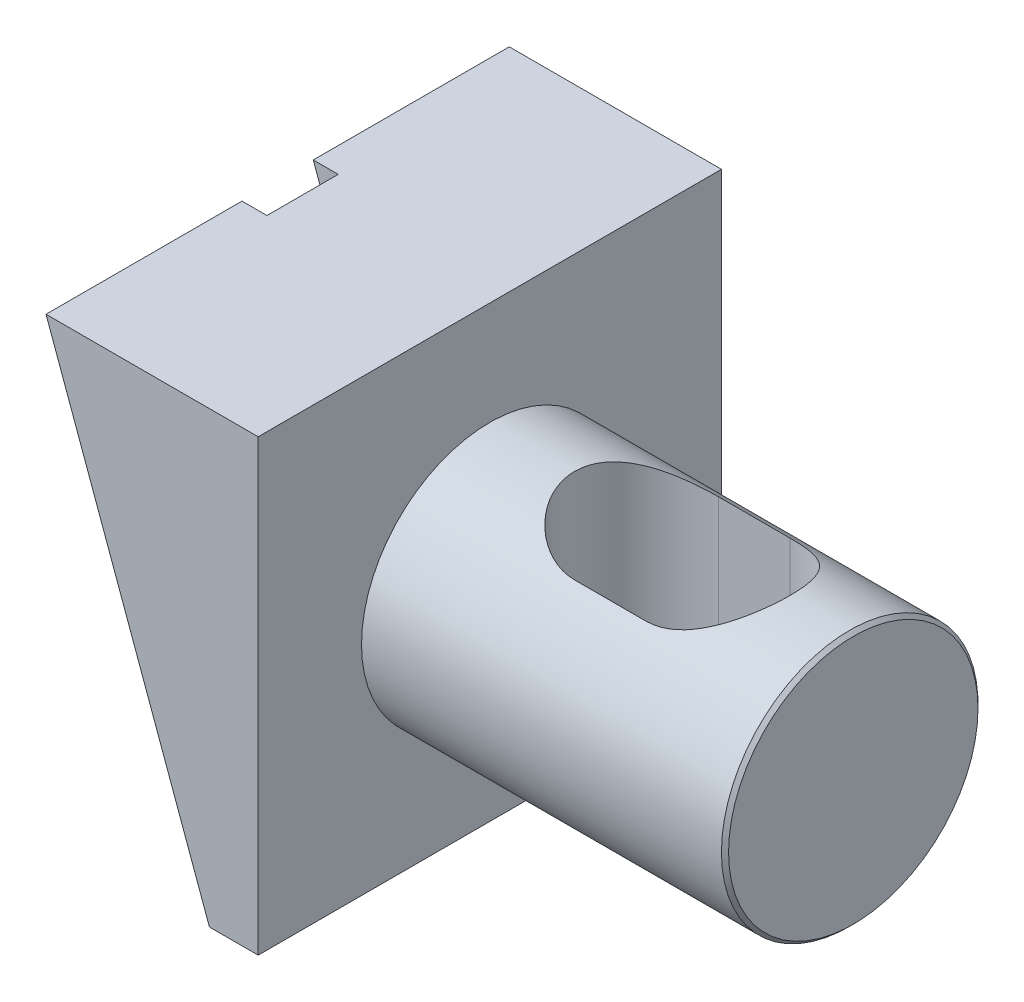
ISO-10303-21;
HEADER;
FILE_DESCRIPTION(('STEP AP214'),'2;1');
FILE_NAME('part.step','',(''),(''),'','','');
FILE_SCHEMA(('AUTOMOTIVE_DESIGN { 1 0 10303 214 1 1 1 1 }'));
ENDSEC;
DATA;
#1=APPLICATION_CONTEXT('core data for automotive mechanical design processes');
#2=APPLICATION_PROTOCOL_DEFINITION('international standard','automotive_design',2000,#1);
#3=PRODUCT_CONTEXT('',#1,'mechanical');
#4=PRODUCT('Part','Part','',(#3));
#5=PRODUCT_RELATED_PRODUCT_CATEGORY('part','',(#4));
#6=PRODUCT_DEFINITION_FORMATION('','',#4);
#7=PRODUCT_DEFINITION_CONTEXT('part definition',#1,'design');
#8=PRODUCT_DEFINITION('design','',#6,#7);
#9=PRODUCT_DEFINITION_SHAPE('','',#8);
#10=(LENGTH_UNIT() NAMED_UNIT(*) SI_UNIT(.MILLI.,.METRE.));
#11=(NAMED_UNIT(*) PLANE_ANGLE_UNIT() SI_UNIT($,.RADIAN.));
#12=(NAMED_UNIT(*) SI_UNIT($,.STERADIAN.) SOLID_ANGLE_UNIT());
#13=UNCERTAINTY_MEASURE_WITH_UNIT(LENGTH_MEASURE(1.E-05),#10,'distance_accuracy_value','');
#14=(GEOMETRIC_REPRESENTATION_CONTEXT(3) GLOBAL_UNCERTAINTY_ASSIGNED_CONTEXT((#13)) GLOBAL_UNIT_ASSIGNED_CONTEXT((#10,
#11,#12)) REPRESENTATION_CONTEXT('',''));
#15=CARTESIAN_POINT('',(0.,0.,0.));
#16=DIRECTION('',(0.,0.,1.));
#17=DIRECTION('',(1.,0.,0.));
#18=AXIS2_PLACEMENT_3D('',#15,#16,#17);
#19=CARTESIAN_POINT('',(-80.2,30.5,0.));
#20=DIRECTION('',(1.,0.,0.));
#21=DIRECTION('',(0.,0.,-1.));
#22=AXIS2_PLACEMENT_3D('',#19,#20,#21);
#23=PLANE('',#22);
#24=CARTESIAN_POINT('',(-80.2,30.5,0.));
#25=DIRECTION('',(-1.,0.,0.));
#26=DIRECTION('',(0.,0.,1.));
#27=AXIS2_PLACEMENT_3D('',#24,#25,#26);
#28=CIRCLE('',#27,10.);
#29=CARTESIAN_POINT('',(-80.2,30.5,10.));
#30=VERTEX_POINT('',#29);
#31=EDGE_CURVE('E253',#30,#30,#28,.T.);
#32=ORIENTED_EDGE('',*,*,#31,.T.);
#33=EDGE_LOOP('',(#32));
#34=FACE_BOUND('',#33,.T.);
#35=CARTESIAN_POINT('',(-80.2,30.5,0.));
#36=DIRECTION('',(1.,0.,0.));
#37=DIRECTION('',(0.,0.,-1.));
#38=AXIS2_PLACEMENT_3D('',#35,#36,#37);
#39=CIRCLE('',#38,3.);
#40=CARTESIAN_POINT('',(-80.2,30.5,-3.));
#41=VERTEX_POINT('',#40);
#42=EDGE_CURVE('E11',#41,#41,#39,.F.);
#43=ORIENTED_EDGE('',*,*,#42,.F.);
#44=EDGE_LOOP('',(#43));
#45=FACE_BOUND('',#44,.T.);
#46=ADVANCED_FACE('F34',(#34,#45),#23,.F.);
#47=CARTESIAN_POINT('',(-55.2,43.5,0.));
#48=DIRECTION('',(-1.,0.,0.));
#49=DIRECTION('',(0.,0.,1.));
#50=AXIS2_PLACEMENT_3D('',#47,#48,#49);
#51=PLANE('',#50);
#52=CARTESIAN_POINT('',(-55.2,30.5,0.));
#53=DIRECTION('',(-1.,0.,0.));
#54=DIRECTION('',(0.,0.,1.));
#55=AXIS2_PLACEMENT_3D('',#52,#53,#54);
#56=CIRCLE('',#55,13.);
#57=CARTESIAN_POINT('',(-55.2,30.5,13.));
#58=VERTEX_POINT('',#57);
#59=EDGE_CURVE('E256',#58,#58,#56,.T.);
#60=ORIENTED_EDGE('',*,*,#59,.T.);
#61=EDGE_LOOP('',(#60));
#62=FACE_BOUND('',#61,.T.);
#63=CARTESIAN_POINT('',(-55.2,30.5,0.));
#64=DIRECTION('',(-1.,0.,0.));
#65=DIRECTION('',(0.,0.,1.));
#66=AXIS2_PLACEMENT_3D('',#63,#64,#65);
#67=CIRCLE('',#66,10.);
#68=CARTESIAN_POINT('',(-55.2,30.5,10.));
#69=VERTEX_POINT('',#68);
#70=EDGE_CURVE('E250',#69,#69,#67,.T.);
#71=ORIENTED_EDGE('',*,*,#70,.F.);
#72=EDGE_LOOP('',(#71));
#73=FACE_BOUND('',#72,.T.);
#74=ADVANCED_FACE('F432',(#62,#73),#51,.T.);
#75=CARTESIAN_POINT('',(-80.772059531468,63.,32.5));
#76=DIRECTION('',(0.939692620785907,0.342020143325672,0.));
#77=DIRECTION('',(-0.342020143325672,0.939692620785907,0.));
#78=AXIS2_PLACEMENT_3D('',#75,#76,#77);
#79=PLANE('',#78);
#80=CARTESIAN_POINT('',(-68.9430269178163,30.5,0.));
#81=DIRECTION('',(0.939692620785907,0.342020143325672,0.));
#82=DIRECTION('',(-0.342020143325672,0.939692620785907,0.));
#83=AXIS2_PLACEMENT_3D('',#80,#81,#82);
#84=ELLIPSE('',#83,13.8343110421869,13.);
#85=CARTESIAN_POINT('',(-73.3106697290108,42.5,-5.));
#86=VERTEX_POINT('',#85);
#87=CARTESIAN_POINT('',(-64.5753841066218,18.5,-5.));
#88=VERTEX_POINT('',#87);
#89=EDGE_CURVE('E265',#86,#88,#84,.F.);
#90=ORIENTED_EDGE('',*,*,#89,.F.);
#91=DIRECTION('',(0.342020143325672,-0.939692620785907,0.));
#92=VECTOR('',#91,1.);
#93=CARTESIAN_POINT('',(-80.772059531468,63.,-5.));
#94=LINE('',#93,#92);
#95=CARTESIAN_POINT('',(-80.772059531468,63.,-5.));
#96=VERTEX_POINT('',#95);
#97=EDGE_CURVE('E292',#96,#86,#94,.T.);
#98=ORIENTED_EDGE('',*,*,#97,.F.);
#99=DIRECTION('',(0.,0.,-1.));
#100=VECTOR('',#99,1.);
#101=CARTESIAN_POINT('',(-80.772059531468,63.,32.5));
#102=LINE('',#101,#100);
#103=CARTESIAN_POINT('',(-80.772059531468,63.,-32.5));
#104=VERTEX_POINT('',#103);
#105=EDGE_CURVE('E339',#96,#104,#102,.T.);
#106=ORIENTED_EDGE('',*,*,#105,.T.);
#107=DIRECTION('',(0.342020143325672,-0.939692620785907,0.));
#108=VECTOR('',#107,1.);
#109=CARTESIAN_POINT('',(-80.772059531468,63.,-32.5));
#110=LINE('',#109,#108);
#111=CARTESIAN_POINT('',(-57.841934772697,0.,-32.5));
#112=VERTEX_POINT('',#111);
#113=EDGE_CURVE('E313',#104,#112,#110,.T.);
#114=ORIENTED_EDGE('',*,*,#113,.T.);
#115=DIRECTION('',(0.,0.,-1.));
#116=VECTOR('',#115,1.);
#117=CARTESIAN_POINT('',(-57.841934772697,0.,32.5));
#118=LINE('',#117,#116);
#119=CARTESIAN_POINT('',(-57.841934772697,0.,-5.));
#120=VERTEX_POINT('',#119);
#121=EDGE_CURVE('E335',#120,#112,#118,.T.);
#122=ORIENTED_EDGE('',*,*,#121,.F.);
#123=EDGE_CURVE('E291',#88,#120,#94,.T.);
#124=ORIENTED_EDGE('',*,*,#123,.F.);
#125=EDGE_LOOP('',(#90,#98,#106,#114,#122,#124));
#126=FACE_BOUND('',#125,.T.);
#127=ADVANCED_FACE('F438',(#126),#79,.F.);
#128=CARTESIAN_POINT('',(-68.9430269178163,30.5,0.));
#129=DIRECTION('',(0.939692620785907,0.342020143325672,0.));
#130=DIRECTION('',(-0.342020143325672,0.939692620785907,0.));
#131=AXIS2_PLACEMENT_3D('',#128,#129,#130);
#132=ELLIPSE('',#131,13.8343110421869,13.);
#133=CARTESIAN_POINT('',(-64.5753841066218,18.5,5.));
#134=VERTEX_POINT('',#133);
#135=CARTESIAN_POINT('',(-73.3106697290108,42.5,5.));
#136=VERTEX_POINT('',#135);
#137=EDGE_CURVE('E263',#134,#136,#132,.F.);
#138=ORIENTED_EDGE('',*,*,#137,.F.);
#139=DIRECTION('',(0.342020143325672,-0.939692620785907,0.));
#140=VECTOR('',#139,1.);
#141=CARTESIAN_POINT('',(-80.772059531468,63.,5.));
#142=LINE('',#141,#140);
#143=CARTESIAN_POINT('',(-57.841934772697,0.,5.));
#144=VERTEX_POINT('',#143);
#145=EDGE_CURVE('E295',#134,#144,#142,.T.);
#146=ORIENTED_EDGE('',*,*,#145,.T.);
#147=CARTESIAN_POINT('',(-57.841934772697,0.,32.5));
#148=VERTEX_POINT('',#147);
#149=EDGE_CURVE('E336',#148,#144,#118,.T.);
#150=ORIENTED_EDGE('',*,*,#149,.F.);
#151=DIRECTION('',(0.342020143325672,-0.939692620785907,0.));
#152=VECTOR('',#151,1.);
#153=CARTESIAN_POINT('',(-80.772059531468,63.,32.5));
#154=LINE('',#153,#152);
#155=CARTESIAN_POINT('',(-80.772059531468,63.,32.5));
#156=VERTEX_POINT('',#155);
#157=EDGE_CURVE('E325',#156,#148,#154,.T.);
#158=ORIENTED_EDGE('',*,*,#157,.F.);
#159=CARTESIAN_POINT('',(-80.772059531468,63.,5.));
#160=VERTEX_POINT('',#159);
#161=EDGE_CURVE('E340',#156,#160,#102,.T.);
#162=ORIENTED_EDGE('',*,*,#161,.T.);
#163=EDGE_CURVE('E296',#160,#136,#142,.T.);
#164=ORIENTED_EDGE('',*,*,#163,.T.);
#165=EDGE_LOOP('',(#138,#146,#150,#158,#162,#164));
#166=FACE_BOUND('',#165,.T.);
#167=ADVANCED_FACE('F457',(#166),#79,.F.);
#168=CARTESIAN_POINT('',(-92.,0.,5.));
#169=DIRECTION('',(0.,0.,1.));
#170=DIRECTION('',(1.,0.,0.));
#171=AXIS2_PLACEMENT_3D('',#168,#169,#170);
#172=PLANE('',#171);
#173=DIRECTION('',(-1.,0.,0.));
#174=VECTOR('',#173,1.);
#175=CARTESIAN_POINT('',(-55.2,42.5,5.));
#176=LINE('',#175,#174);
#177=CARTESIAN_POINT('',(-69.8106697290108,42.5,5.));
#178=VERTEX_POINT('',#177);
#179=EDGE_CURVE('E58',#136,#178,#176,.F.);
#180=ORIENTED_EDGE('',*,*,#179,.F.);
#181=ORIENTED_EDGE('',*,*,#163,.F.);
#182=DIRECTION('',(-1.,0.,0.));
#183=VECTOR('',#182,1.);
#184=CARTESIAN_POINT('',(-77.272059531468,63.,5.));
#185=LINE('',#184,#183);
#186=CARTESIAN_POINT('',(-77.272059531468,63.,5.));
#187=VERTEX_POINT('',#186);
#188=EDGE_CURVE('E282',#187,#160,#185,.T.);
#189=ORIENTED_EDGE('',*,*,#188,.F.);
#190=DIRECTION('',(-0.342020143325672,0.939692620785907,0.));
#191=VECTOR('',#190,1.);
#192=CARTESIAN_POINT('',(-54.341934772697,0.,5.));
#193=LINE('',#192,#191);
#194=EDGE_CURVE('E278',#178,#187,#193,.T.);
#195=ORIENTED_EDGE('',*,*,#194,.F.);
#196=EDGE_LOOP('',(#180,#181,#189,#195));
#197=FACE_BOUND('',#196,.T.);
#198=ADVANCED_FACE('F455',(#197),#172,.F.);
#199=DIRECTION('',(-1.,0.,0.));
#200=VECTOR('',#199,1.);
#201=CARTESIAN_POINT('',(-55.2,18.5,5.));
#202=LINE('',#201,#200);
#203=CARTESIAN_POINT('',(-61.0753841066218,18.5,5.));
#204=VERTEX_POINT('',#203);
#205=EDGE_CURVE('E270',#204,#134,#202,.T.);
#206=ORIENTED_EDGE('',*,*,#205,.F.);
#207=CARTESIAN_POINT('',(-54.341934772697,0.,5.));
#208=VERTEX_POINT('',#207);
#209=EDGE_CURVE('E279',#208,#204,#193,.T.);
#210=ORIENTED_EDGE('',*,*,#209,.F.);
#211=DIRECTION('',(1.,0.,0.));
#212=VECTOR('',#211,1.);
#213=CARTESIAN_POINT('',(-57.841934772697,0.,5.));
#214=LINE('',#213,#212);
#215=EDGE_CURVE('E473',#144,#208,#214,.T.);
#216=ORIENTED_EDGE('',*,*,#215,.F.);
#217=ORIENTED_EDGE('',*,*,#145,.F.);
#218=EDGE_LOOP('',(#206,#210,#216,#217));
#219=FACE_BOUND('',#218,.T.);
#220=ADVANCED_FACE('F453',(#219),#172,.F.);
#221=CARTESIAN_POINT('',(-92.,0.,-5.));
#222=DIRECTION('',(0.,0.,1.));
#223=DIRECTION('',(1.,0.,0.));
#224=AXIS2_PLACEMENT_3D('',#221,#222,#223);
#225=PLANE('',#224);
#226=ORIENTED_EDGE('',*,*,#97,.T.);
#227=DIRECTION('',(-1.,0.,0.));
#228=VECTOR('',#227,1.);
#229=CARTESIAN_POINT('',(-55.2,42.5,-5.));
#230=LINE('',#229,#228);
#231=CARTESIAN_POINT('',(-69.8106697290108,42.5,-5.));
#232=VERTEX_POINT('',#231);
#233=EDGE_CURVE('E259',#86,#232,#230,.F.);
#234=ORIENTED_EDGE('',*,*,#233,.T.);
#235=DIRECTION('',(-0.342020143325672,0.939692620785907,0.));
#236=VECTOR('',#235,1.);
#237=CARTESIAN_POINT('',(-54.341934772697,0.,-5.));
#238=LINE('',#237,#236);
#239=CARTESIAN_POINT('',(-77.272059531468,63.,-5.));
#240=VERTEX_POINT('',#239);
#241=EDGE_CURVE('E272',#232,#240,#238,.T.);
#242=ORIENTED_EDGE('',*,*,#241,.T.);
#243=DIRECTION('',(-1.,0.,0.));
#244=VECTOR('',#243,1.);
#245=CARTESIAN_POINT('',(-77.272059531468,63.,-5.));
#246=LINE('',#245,#244);
#247=EDGE_CURVE('E276',#240,#96,#246,.T.);
#248=ORIENTED_EDGE('',*,*,#247,.T.);
#249=EDGE_LOOP('',(#226,#234,#242,#248));
#250=FACE_BOUND('',#249,.T.);
#251=ADVANCED_FACE('F449',(#250),#225,.T.);
#252=CARTESIAN_POINT('',(-54.341934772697,0.,-5.));
#253=VERTEX_POINT('',#252);
#254=CARTESIAN_POINT('',(-61.0753841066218,18.5,-5.));
#255=VERTEX_POINT('',#254);
#256=EDGE_CURVE('E273',#253,#255,#238,.T.);
#257=ORIENTED_EDGE('',*,*,#256,.T.);
#258=DIRECTION('',(-1.,0.,0.));
#259=VECTOR('',#258,1.);
#260=CARTESIAN_POINT('',(-55.2,18.5,-5.));
#261=LINE('',#260,#259);
#262=EDGE_CURVE('E267',#255,#88,#261,.T.);
#263=ORIENTED_EDGE('',*,*,#262,.T.);
#264=ORIENTED_EDGE('',*,*,#123,.T.);
#265=DIRECTION('',(1.,0.,0.));
#266=VECTOR('',#265,1.);
#267=CARTESIAN_POINT('',(-57.841934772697,0.,-5.));
#268=LINE('',#267,#266);
#269=EDGE_CURVE('E389',#120,#253,#268,.T.);
#270=ORIENTED_EDGE('',*,*,#269,.T.);
#271=EDGE_LOOP('',(#257,#263,#264,#270));
#272=FACE_BOUND('',#271,.T.);
#273=ADVANCED_FACE('F452',(#272),#225,.T.);
#274=CARTESIAN_POINT('',(-54.341934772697,0.,5.));
#275=DIRECTION('',(-0.939692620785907,-0.342020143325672,0.));
#276=DIRECTION('',(0.342020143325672,-0.939692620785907,0.));
#277=AXIS2_PLACEMENT_3D('',#274,#275,#276);
#278=PLANE('',#277);
#279=ORIENTED_EDGE('',*,*,#209,.T.);
#280=CARTESIAN_POINT('',(-65.4430269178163,30.5,0.));
#281=DIRECTION('',(-0.939692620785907,-0.342020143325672,0.));
#282=DIRECTION('',(-0.342020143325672,0.939692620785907,0.));
#283=AXIS2_PLACEMENT_3D('',#280,#281,#282);
#284=ELLIPSE('',#283,13.8343110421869,13.);
#285=EDGE_CURVE('E43',#204,#255,#284,.F.);
#286=ORIENTED_EDGE('',*,*,#285,.T.);
#287=ORIENTED_EDGE('',*,*,#256,.F.);
#288=DIRECTION('',(0.,0.,-1.));
#289=VECTOR('',#288,1.);
#290=CARTESIAN_POINT('',(-54.341934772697,0.,5.));
#291=LINE('',#290,#289);
#292=EDGE_CURVE('E288',#208,#253,#291,.T.);
#293=ORIENTED_EDGE('',*,*,#292,.F.);
#294=EDGE_LOOP('',(#279,#286,#287,#293));
#295=FACE_BOUND('',#294,.T.);
#296=ADVANCED_FACE('F429',(#295),#278,.T.);
#297=ORIENTED_EDGE('',*,*,#241,.F.);
#298=EDGE_CURVE('E479',#232,#178,#284,.F.);
#299=ORIENTED_EDGE('',*,*,#298,.T.);
#300=ORIENTED_EDGE('',*,*,#194,.T.);
#301=DIRECTION('',(0.,0.,-1.));
#302=VECTOR('',#301,1.);
#303=CARTESIAN_POINT('',(-77.272059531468,63.,5.));
#304=LINE('',#303,#302);
#305=EDGE_CURVE('E285',#187,#240,#304,.T.);
#306=ORIENTED_EDGE('',*,*,#305,.T.);
#307=EDGE_LOOP('',(#297,#299,#300,#306));
#308=FACE_BOUND('',#307,.T.);
#309=ADVANCED_FACE('F422',(#308),#278,.T.);
#310=CARTESIAN_POINT('',(0.,30.5,0.));
#311=DIRECTION('',(-1.,0.,0.));
#312=DIRECTION('',(0.,0.,1.));
#313=AXIS2_PLACEMENT_3D('',#310,#311,#312);
#314=CYLINDRICAL_SURFACE('',#313,18.);
#315=CARTESIAN_POINT('',(-29.,15.6006711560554,10.1));
#316=CARTESIAN_POINT('',(-29.1295978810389,15.6006749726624,10.1000013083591));
#317=CARTESIAN_POINT('',(-29.259176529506,15.5989794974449,10.0975050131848));
#318=CARTESIAN_POINT('',(-29.518047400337,15.5922285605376,10.0875370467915));
#319=CARTESIAN_POINT('',(-29.647339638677,15.5871732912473,10.0800656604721));
#320=CARTESIAN_POINT('',(-30.0341650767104,15.5670395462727,10.0502391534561));
#321=CARTESIAN_POINT('',(-30.290921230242,15.5469929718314,10.0204715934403));
#322=CARTESIAN_POINT('',(-30.7983014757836,15.4946476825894,9.94191067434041));
#323=CARTESIAN_POINT('',(-31.0489560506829,15.4624364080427,9.8932530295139));
#324=CARTESIAN_POINT('',(-31.5443211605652,15.3869716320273,9.77758336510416));
#325=CARTESIAN_POINT('',(-31.7890307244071,15.3437163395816,9.71056836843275));
#326=CARTESIAN_POINT('',(-32.2702768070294,15.2478110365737,9.55922127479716));
#327=CARTESIAN_POINT('',(-32.5068360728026,15.1951902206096,9.47494287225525));
#328=CARTESIAN_POINT('',(-32.9713508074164,15.0821263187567,9.28983053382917));
#329=CARTESIAN_POINT('',(-33.1993064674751,15.021683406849,9.18899696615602));
#330=CARTESIAN_POINT('',(-33.8698297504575,14.8308723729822,8.86238837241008));
#331=CARTESIAN_POINT('',(-34.2984657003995,14.691146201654,8.61269258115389));
#332=CARTESIAN_POINT('',(-34.9295437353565,14.4654943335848,8.18075885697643));
#333=CARTESIAN_POINT('',(-35.1474126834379,14.3834548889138,8.01829490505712));
#334=CARTESIAN_POINT('',(-35.5691283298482,14.2179276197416,7.67659549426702));
#335=CARTESIAN_POINT('',(-35.7729741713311,14.1344397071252,7.49735901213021));
#336=CARTESIAN_POINT('',(-36.1657857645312,13.9680067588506,7.12286572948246));
#337=CARTESIAN_POINT('',(-36.3547445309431,13.8850619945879,6.92760149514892));
#338=CARTESIAN_POINT('',(-36.7167287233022,13.7216856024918,6.52195961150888));
#339=CARTESIAN_POINT('',(-36.8897593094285,13.6412531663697,6.31158689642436));
#340=CARTESIAN_POINT('',(-37.233939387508,13.4775797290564,5.85668968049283));
#341=CARTESIAN_POINT('',(-37.4034852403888,13.3947490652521,5.61079941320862));
#342=CARTESIAN_POINT('',(-37.72106978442,13.2365095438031,5.10319214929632));
#343=CARTESIAN_POINT('',(-37.8691068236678,13.1611012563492,4.84147393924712));
#344=CARTESIAN_POINT('',(-38.142044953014,13.0199155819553,4.30392991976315));
#345=CARTESIAN_POINT('',(-38.2669594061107,12.9541326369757,4.02811237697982));
#346=CARTESIAN_POINT('',(-38.4921846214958,12.8341436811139,3.46418469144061));
#347=CARTESIAN_POINT('',(-38.5924988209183,12.7799360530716,3.17607627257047));
#348=CARTESIAN_POINT('',(-38.7595758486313,12.6889120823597,2.61511476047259));
#349=CARTESIAN_POINT('',(-38.8284801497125,12.6510020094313,2.34307631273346));
#350=CARTESIAN_POINT('',(-38.9435785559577,12.5873662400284,1.79282679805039));
#351=CARTESIAN_POINT('',(-38.9897738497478,12.5616399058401,1.51461605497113));
#352=CARTESIAN_POINT('',(-39.0587417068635,12.5231408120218,0.954599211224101));
#353=CARTESIAN_POINT('',(-39.0815296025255,12.5103595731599,0.67279558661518));
#354=CARTESIAN_POINT('',(-39.1033749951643,12.4981084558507,0.107990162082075));
#355=CARTESIAN_POINT('',(-39.1024344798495,12.4986374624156,-0.175011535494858));
#356=CARTESIAN_POINT('',(-39.0782454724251,12.5121997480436,-0.708786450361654));
#357=CARTESIAN_POINT('',(-39.057440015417,12.5238636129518,-0.959709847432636));
#358=CARTESIAN_POINT('',(-38.9972787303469,12.557454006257,-1.45860692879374));
#359=CARTESIAN_POINT('',(-38.9579245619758,12.5793796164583,-1.7065808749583));
#360=CARTESIAN_POINT('',(-38.8611338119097,12.6329818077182,-2.19789414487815));
#361=CARTESIAN_POINT('',(-38.803696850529,12.6646585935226,-2.44123337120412));
#362=CARTESIAN_POINT('',(-38.6713768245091,12.7370479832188,-2.92174204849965));
#363=CARTESIAN_POINT('',(-38.596493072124,12.7777609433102,-3.15891125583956));
#364=CARTESIAN_POINT('',(-38.4292395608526,12.8677697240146,-3.62795130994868));
#365=CARTESIAN_POINT('',(-38.3367094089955,12.9171439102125,-3.85974978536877));
#366=CARTESIAN_POINT('',(-38.135449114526,13.0231835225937,-4.3145611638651));
#367=CARTESIAN_POINT('',(-38.0267131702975,13.0798515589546,-4.53757088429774));
#368=CARTESIAN_POINT('',(-37.793946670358,13.1993201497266,-4.97368995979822));
#369=CARTESIAN_POINT('',(-37.6699182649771,13.2621198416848,-5.18680070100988));
#370=CARTESIAN_POINT('',(-37.4073565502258,13.3926721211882,-5.60239226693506));
#371=CARTESIAN_POINT('',(-37.2688180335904,13.4604264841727,-5.80486923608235));
#372=CARTESIAN_POINT('',(-36.9620159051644,13.6072913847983,-6.22013629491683));
#373=CARTESIAN_POINT('',(-36.7921591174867,13.6868300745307,-6.43159934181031));
#374=CARTESIAN_POINT('',(-36.4365847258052,13.8486418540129,-6.83962369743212));
#375=CARTESIAN_POINT('',(-36.2508659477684,13.9309151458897,-7.0361839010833));
#376=CARTESIAN_POINT('',(-35.8642374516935,14.0964273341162,-7.41386302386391));
#377=CARTESIAN_POINT('',(-35.6633089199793,14.1796673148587,-7.5949622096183));
#378=CARTESIAN_POINT('',(-35.2473102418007,14.3450484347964,-7.94067143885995));
#379=CARTESIAN_POINT('',(-35.0322398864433,14.4271895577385,-8.10528123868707));
#380=CARTESIAN_POINT('',(-34.5677299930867,14.5959607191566,-8.43199054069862));
#381=CARTESIAN_POINT('',(-34.3169649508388,14.6822783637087,-8.59237351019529));
#382=CARTESIAN_POINT('',(-33.8005398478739,14.8483094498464,-8.89122156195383));
#383=CARTESIAN_POINT('',(-33.5348775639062,14.9280219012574,-9.02968336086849));
#384=CARTESIAN_POINT('',(-32.9907770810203,15.07767561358,-9.28296837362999));
#385=CARTESIAN_POINT('',(-32.7123754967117,15.147642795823,-9.39785469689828));
#386=CARTESIAN_POINT('',(-32.1439128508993,15.2750994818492,-9.60296923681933));
#387=CARTESIAN_POINT('',(-31.8538565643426,15.3325940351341,-9.69320743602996));
#388=CARTESIAN_POINT('',(-31.3527841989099,15.4174213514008,-9.82445650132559));
#389=CARTESIAN_POINT('',(-31.1441398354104,15.4486291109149,-9.87211522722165));
#390=CARTESIAN_POINT('',(-30.7232482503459,15.5027986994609,-9.95421346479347));
#391=CARTESIAN_POINT('',(-30.5110021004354,15.5257629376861,-9.98865683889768));
#392=CARTESIAN_POINT('',(-30.0830287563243,15.5628847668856,-10.0440914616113));
#393=CARTESIAN_POINT('',(-29.8672903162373,15.5770029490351,-10.0650225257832));
#394=CARTESIAN_POINT('',(-29.4343758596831,15.5959232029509,-10.0929948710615));
#395=CARTESIAN_POINT('',(-29.2171990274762,15.6007194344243,-10.1000274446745));
#396=CARTESIAN_POINT('',(-29.,15.6006711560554,-10.1));
#397=B_SPLINE_CURVE_WITH_KNOTS('',3,(#315,#316,#317,#318,#319,#320,#321,#322,#323,#324,#325,
#326,#327,#328,#329,#330,#331,#332,#333,#334,#335,#336,#337,#338,#339,#340,#341,#342,#343,#344,
#345,#346,#347,#348,#349,#350,#351,#352,#353,#354,#355,#356,#357,#358,#359,#360,#361,#362,#363,
#364,#365,#366,#367,#368,#369,#370,#371,#372,#373,#374,#375,#376,#377,#378,#379,#380,#381,#382,
#383,#384,#385,#386,#387,#388,#389,#390,#391,#392,#393,#394,#395,#396),.UNSPECIFIED.,.F.,.F.,(4,
2,2,2,2,2,2,2,2,2,2,2,2,2,2,2,2,2,2,2,2,2,2,2,2,2,2,2,2,2,2,2,2,2,2,2,2,2,2,2,4),(0.,
0.388720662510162,0.777419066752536,1.55399637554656,2.32509470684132,3.09631816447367,
3.86517834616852,4.63402142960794,6.17357674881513,7.02459341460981,7.87566203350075,
8.72712764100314,9.57831642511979,10.5069530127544,11.4356608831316,12.3638303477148,
13.2918700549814,14.140213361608,14.9885122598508,15.8362551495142,16.6839270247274,
17.4391916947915,18.194388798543,18.9496017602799,19.7048444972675,20.4673106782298,
21.2300504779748,21.9926831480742,22.7555904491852,23.6026736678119,24.4498196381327,
25.2980311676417,26.146255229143,27.0748708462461,28.0036254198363,28.9298604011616,
29.855719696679,30.5040288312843,31.1521483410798,31.8031350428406,32.4545294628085),.UNSPECIFIED.);
#398=CARTESIAN_POINT('',(-29.,15.6006711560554,10.1));
#399=VERTEX_POINT('',#398);
#400=CARTESIAN_POINT('',(-29.,15.6006711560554,-10.1));
#401=VERTEX_POINT('',#400);
#402=EDGE_CURVE('E399',#399,#401,#397,.T.);
#403=ORIENTED_EDGE('',*,*,#402,.F.);
#404=DIRECTION('',(-1.,0.,0.));
#405=VECTOR('',#404,1.);
#406=CARTESIAN_POINT('',(0.,15.6006711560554,10.1));
#407=LINE('',#406,#405);
#408=CARTESIAN_POINT('',(-19.,15.6006711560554,10.1));
#409=VERTEX_POINT('',#408);
#410=EDGE_CURVE('E360',#409,#399,#407,.T.);
#411=ORIENTED_EDGE('',*,*,#410,.F.);
#412=CARTESIAN_POINT('',(-19.,15.6006711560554,-10.1));
#413=CARTESIAN_POINT('',(-18.8704021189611,15.6006749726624,-10.1000013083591));
#414=CARTESIAN_POINT('',(-18.740823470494,15.5989794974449,-10.0975050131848));
#415=CARTESIAN_POINT('',(-18.481952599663,15.5922285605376,-10.0875370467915));
#416=CARTESIAN_POINT('',(-18.352660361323,15.5871732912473,-10.0800656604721));
#417=CARTESIAN_POINT('',(-17.9658349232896,15.5670395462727,-10.0502391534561));
#418=CARTESIAN_POINT('',(-17.709078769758,15.5469929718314,-10.0204715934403));
#419=CARTESIAN_POINT('',(-17.2016985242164,15.4946476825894,-9.94191067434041));
#420=CARTESIAN_POINT('',(-16.9510439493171,15.4624364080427,-9.8932530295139));
#421=CARTESIAN_POINT('',(-16.4556788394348,15.3869716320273,-9.77758336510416));
#422=CARTESIAN_POINT('',(-16.2109692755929,15.3437163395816,-9.71056836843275));
#423=CARTESIAN_POINT('',(-15.7297231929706,15.2478110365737,-9.55922127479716));
#424=CARTESIAN_POINT('',(-15.4931639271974,15.1951902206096,-9.47494287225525));
#425=CARTESIAN_POINT('',(-15.0286491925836,15.0821263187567,-9.28983053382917));
#426=CARTESIAN_POINT('',(-14.8006935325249,15.021683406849,-9.18899696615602));
#427=CARTESIAN_POINT('',(-14.1301702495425,14.8308723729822,-8.86238837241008));
#428=CARTESIAN_POINT('',(-13.7015342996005,14.691146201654,-8.61269258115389));
#429=CARTESIAN_POINT('',(-13.0704562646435,14.4654943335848,-8.18075885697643));
#430=CARTESIAN_POINT('',(-12.8525873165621,14.3834548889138,-8.01829490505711));
#431=CARTESIAN_POINT('',(-12.4308716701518,14.2179276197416,-7.67659549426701));
#432=CARTESIAN_POINT('',(-12.2270258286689,14.1344397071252,-7.49735901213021));
#433=CARTESIAN_POINT('',(-11.8342142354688,13.9680067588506,-7.12286572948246));
#434=CARTESIAN_POINT('',(-11.6452554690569,13.8850619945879,-6.92760149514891));
#435=CARTESIAN_POINT('',(-11.2832712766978,13.7216856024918,-6.52195961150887));
#436=CARTESIAN_POINT('',(-11.1102406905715,13.6412531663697,-6.31158689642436));
#437=CARTESIAN_POINT('',(-10.766060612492,13.4775797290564,-5.85668968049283));
#438=CARTESIAN_POINT('',(-10.5965147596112,13.3947490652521,-5.61079941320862));
#439=CARTESIAN_POINT('',(-10.27893021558,13.2365095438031,-5.10319214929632));
#440=CARTESIAN_POINT('',(-10.1308931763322,13.1611012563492,-4.84147393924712));
#441=CARTESIAN_POINT('',(-9.85795504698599,13.0199155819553,-4.30392991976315));
#442=CARTESIAN_POINT('',(-9.73304059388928,12.9541326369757,-4.02811237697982));
#443=CARTESIAN_POINT('',(-9.50781537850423,12.8341436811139,-3.46418469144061));
#444=CARTESIAN_POINT('',(-9.40750117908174,12.7799360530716,-3.17607627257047));
#445=CARTESIAN_POINT('',(-9.24042415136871,12.6889120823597,-2.61511476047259));
#446=CARTESIAN_POINT('',(-9.17151985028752,12.6510020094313,-2.34307631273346));
#447=CARTESIAN_POINT('',(-9.05642144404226,12.5873662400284,-1.79282679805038));
#448=CARTESIAN_POINT('',(-9.01022615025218,12.5616399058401,-1.51461605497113));
#449=CARTESIAN_POINT('',(-8.94125829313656,12.5231408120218,-0.954599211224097));
#450=CARTESIAN_POINT('',(-8.91847039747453,12.5103595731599,-0.672795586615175));
#451=CARTESIAN_POINT('',(-8.8966250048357,12.4981084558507,-0.10799016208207));
#452=CARTESIAN_POINT('',(-8.89756552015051,12.4986374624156,0.175011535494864));
#453=CARTESIAN_POINT('',(-8.92175452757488,12.5121997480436,0.708786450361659));
#454=CARTESIAN_POINT('',(-8.942559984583,12.5238636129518,0.959709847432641));
#455=CARTESIAN_POINT('',(-9.00272126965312,12.557454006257,1.45860692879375));
#456=CARTESIAN_POINT('',(-9.04207543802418,12.5793796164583,1.7065808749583));
#457=CARTESIAN_POINT('',(-9.13886618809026,12.6329818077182,2.19789414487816));
#458=CARTESIAN_POINT('',(-9.19630314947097,12.6646585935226,2.44123337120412));
#459=CARTESIAN_POINT('',(-9.32862317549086,12.7370479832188,2.92174204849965));
#460=CARTESIAN_POINT('',(-9.40350692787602,12.7777609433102,3.15891125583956));
#461=CARTESIAN_POINT('',(-9.57076043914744,12.8677697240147,3.62795130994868));
#462=CARTESIAN_POINT('',(-9.66329059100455,12.9171439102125,3.85974978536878));
#463=CARTESIAN_POINT('',(-9.86455088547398,13.0231835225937,4.31456116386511));
#464=CARTESIAN_POINT('',(-9.97328682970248,13.0798515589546,4.53757088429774));
#465=CARTESIAN_POINT('',(-10.206053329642,13.1993201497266,4.97368995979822));
#466=CARTESIAN_POINT('',(-10.3300817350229,13.2621198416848,5.18680070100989));
#467=CARTESIAN_POINT('',(-10.5926434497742,13.3926721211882,5.60239226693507));
#468=CARTESIAN_POINT('',(-10.7311819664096,13.4604264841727,5.80486923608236));
#469=CARTESIAN_POINT('',(-11.0379840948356,13.6072913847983,6.22013629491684));
#470=CARTESIAN_POINT('',(-11.2078408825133,13.6868300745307,6.43159934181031));
#471=CARTESIAN_POINT('',(-11.5634152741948,13.8486418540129,6.83962369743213));
#472=CARTESIAN_POINT('',(-11.7491340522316,13.9309151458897,7.03618390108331));
#473=CARTESIAN_POINT('',(-12.1357625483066,14.0964273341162,7.41386302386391));
#474=CARTESIAN_POINT('',(-12.3366910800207,14.1796673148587,7.59496220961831));
#475=CARTESIAN_POINT('',(-12.7526897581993,14.3450484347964,7.94067143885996));
#476=CARTESIAN_POINT('',(-12.9677601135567,14.4271895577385,8.10528123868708));
#477=CARTESIAN_POINT('',(-13.4322700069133,14.5959607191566,8.43199054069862));
#478=CARTESIAN_POINT('',(-13.6830350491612,14.6822783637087,8.59237351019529));
#479=CARTESIAN_POINT('',(-14.1994601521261,14.8483094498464,8.89122156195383));
#480=CARTESIAN_POINT('',(-14.4651224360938,14.9280219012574,9.02968336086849));
#481=CARTESIAN_POINT('',(-15.0092229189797,15.07767561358,9.28296837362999));
#482=CARTESIAN_POINT('',(-15.2876245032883,15.147642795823,9.39785469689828));
#483=CARTESIAN_POINT('',(-15.8560871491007,15.2750994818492,9.60296923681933));
#484=CARTESIAN_POINT('',(-16.1461434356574,15.3325940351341,9.69320743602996));
#485=CARTESIAN_POINT('',(-16.6472158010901,15.4174213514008,9.82445650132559));
#486=CARTESIAN_POINT('',(-16.8558601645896,15.4486291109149,9.87211522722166));
#487=CARTESIAN_POINT('',(-17.2767517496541,15.5027986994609,9.95421346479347));
#488=CARTESIAN_POINT('',(-17.4889978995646,15.5257629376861,9.98865683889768));
#489=CARTESIAN_POINT('',(-17.9169712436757,15.5628847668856,10.0440914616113));
#490=CARTESIAN_POINT('',(-18.1327096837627,15.5770029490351,10.0650225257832));
#491=CARTESIAN_POINT('',(-18.5656241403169,15.5959232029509,10.0929948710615));
#492=CARTESIAN_POINT('',(-18.7828009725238,15.6007194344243,10.1000274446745));
#493=CARTESIAN_POINT('',(-19.,15.6006711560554,10.1));
#494=B_SPLINE_CURVE_WITH_KNOTS('',3,(#412,#413,#414,#415,#416,#417,#418,#419,#420,#421,#422,
#423,#424,#425,#426,#427,#428,#429,#430,#431,#432,#433,#434,#435,#436,#437,#438,#439,#440,#441,
#442,#443,#444,#445,#446,#447,#448,#449,#450,#451,#452,#453,#454,#455,#456,#457,#458,#459,#460,
#461,#462,#463,#464,#465,#466,#467,#468,#469,#470,#471,#472,#473,#474,#475,#476,#477,#478,#479,
#480,#481,#482,#483,#484,#485,#486,#487,#488,#489,#490,#491,#492,#493),.UNSPECIFIED.,.F.,.F.,(4,
2,2,2,2,2,2,2,2,2,2,2,2,2,2,2,2,2,2,2,2,2,2,2,2,2,2,2,2,2,2,2,2,2,2,2,2,2,2,2,4),(0.,
0.388720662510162,0.777419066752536,1.55399637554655,2.32509470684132,3.09631816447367,
3.86517834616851,4.63402142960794,6.17357674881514,7.02459341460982,7.87566203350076,
8.72712764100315,9.57831642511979,10.5069530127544,11.4356608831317,12.3638303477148,
13.2918700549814,14.140213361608,14.9885122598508,15.8362551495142,16.6839270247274,
17.4391916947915,18.194388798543,18.9496017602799,19.7048444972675,20.4673106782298,
21.2300504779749,21.9926831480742,22.7555904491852,23.6026736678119,24.4498196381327,
25.2980311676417,26.146255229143,27.0748708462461,28.0036254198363,28.9298604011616,
29.855719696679,30.5040288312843,31.1521483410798,31.8031350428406,32.4545294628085),.UNSPECIFIED.);
#495=CARTESIAN_POINT('',(-19.,15.6006711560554,-10.1));
#496=VERTEX_POINT('',#495);
#497=EDGE_CURVE('E354',#496,#409,#494,.T.);
#498=ORIENTED_EDGE('',*,*,#497,.F.);
#499=DIRECTION('',(-1.,0.,0.));
#500=VECTOR('',#499,1.);
#501=CARTESIAN_POINT('',(0.,15.6006711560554,-10.1));
#502=LINE('',#501,#500);
#503=EDGE_CURVE('E352',#401,#496,#502,.F.);
#504=ORIENTED_EDGE('',*,*,#503,.F.);
#505=EDGE_LOOP('',(#403,#411,#498,#504));
#506=FACE_BOUND('',#505,.T.);
#507=CARTESIAN_POINT('',(-51.,30.5,0.));
#508=DIRECTION('',(-1.,0.,0.));
#509=DIRECTION('',(0.,0.,1.));
#510=AXIS2_PLACEMENT_3D('',#507,#508,#509);
#511=CIRCLE('',#510,18.);
#512=CARTESIAN_POINT('',(-51.,30.5,18.));
#513=VERTEX_POINT('',#512);
#514=EDGE_CURVE('E349',#513,#513,#511,.T.);
#515=ORIENTED_EDGE('',*,*,#514,.F.);
#516=EDGE_LOOP('',(#515));
#517=FACE_BOUND('',#516,.T.);
#518=CARTESIAN_POINT('',(-0.5,30.5,0.));
#519=DIRECTION('',(-1.,0.,0.));
#520=DIRECTION('',(0.,0.,1.));
#521=AXIS2_PLACEMENT_3D('',#518,#519,#520);
#522=CIRCLE('',#521,18.);
#523=CARTESIAN_POINT('',(-0.5,30.5,18.));
#524=VERTEX_POINT('',#523);
#525=EDGE_CURVE('E346',#524,#524,#522,.T.);
#526=ORIENTED_EDGE('',*,*,#525,.T.);
#527=EDGE_LOOP('',(#526));
#528=FACE_BOUND('',#527,.T.);
#529=CARTESIAN_POINT('',(-29.,45.3993288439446,-10.1));
#530=CARTESIAN_POINT('',(-29.1295978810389,45.3993250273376,-10.1000013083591));
#531=CARTESIAN_POINT('',(-29.259176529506,45.4010205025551,-10.0975050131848));
#532=CARTESIAN_POINT('',(-29.518047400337,45.4077714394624,-10.0875370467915));
#533=CARTESIAN_POINT('',(-29.647339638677,45.4128267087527,-10.0800656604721));
#534=CARTESIAN_POINT('',(-30.0341650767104,45.4329604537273,-10.0502391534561));
#535=CARTESIAN_POINT('',(-30.290921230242,45.4530070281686,-10.0204715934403));
#536=CARTESIAN_POINT('',(-30.7983014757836,45.5053523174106,-9.94191067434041));
#537=CARTESIAN_POINT('',(-31.0489560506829,45.5375635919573,-9.8932530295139));
#538=CARTESIAN_POINT('',(-31.5443211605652,45.6130283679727,-9.77758336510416));
#539=CARTESIAN_POINT('',(-31.7890307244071,45.6562836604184,-9.71056836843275));
#540=CARTESIAN_POINT('',(-32.2702768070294,45.7521889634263,-9.55922127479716));
#541=CARTESIAN_POINT('',(-32.5068360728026,45.8048097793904,-9.47494287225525));
#542=CARTESIAN_POINT('',(-32.9713508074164,45.9178736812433,-9.28983053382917));
#543=CARTESIAN_POINT('',(-33.1993064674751,45.978316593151,-9.18899696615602));
#544=CARTESIAN_POINT('',(-33.8698297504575,46.1691276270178,-8.86238837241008));
#545=CARTESIAN_POINT('',(-34.2984657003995,46.308853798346,-8.61269258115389));
#546=CARTESIAN_POINT('',(-34.9295437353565,46.5345056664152,-8.18075885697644));
#547=CARTESIAN_POINT('',(-35.1474126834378,46.6165451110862,-8.01829490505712));
#548=CARTESIAN_POINT('',(-35.5691283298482,46.7820723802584,-7.67659549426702));
#549=CARTESIAN_POINT('',(-35.7729741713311,46.8655602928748,-7.49735901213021));
#550=CARTESIAN_POINT('',(-36.1657857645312,47.0319932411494,-7.12286572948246));
#551=CARTESIAN_POINT('',(-36.3547445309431,47.1149380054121,-6.92760149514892));
#552=CARTESIAN_POINT('',(-36.7167287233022,47.2783143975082,-6.52195961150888));
#553=CARTESIAN_POINT('',(-36.8897593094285,47.3587468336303,-6.31158689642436));
#554=CARTESIAN_POINT('',(-37.233939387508,47.5224202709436,-5.85668968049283));
#555=CARTESIAN_POINT('',(-37.4034852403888,47.6052509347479,-5.61079941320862));
#556=CARTESIAN_POINT('',(-37.72106978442,47.7634904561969,-5.10319214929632));
#557=CARTESIAN_POINT('',(-37.8691068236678,47.8388987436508,-4.84147393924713));
#558=CARTESIAN_POINT('',(-38.142044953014,47.9800844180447,-4.30392991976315));
#559=CARTESIAN_POINT('',(-38.2669594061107,48.0458673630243,-4.02811237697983));
#560=CARTESIAN_POINT('',(-38.4921846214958,48.1658563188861,-3.46418469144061));
#561=CARTESIAN_POINT('',(-38.5924988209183,48.2200639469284,-3.17607627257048));
#562=CARTESIAN_POINT('',(-38.7595758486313,48.3110879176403,-2.61511476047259));
#563=CARTESIAN_POINT('',(-38.8284801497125,48.3489979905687,-2.34307631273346));
#564=CARTESIAN_POINT('',(-38.9435785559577,48.4126337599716,-1.79282679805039));
#565=CARTESIAN_POINT('',(-38.9897738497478,48.4383600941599,-1.51461605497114));
#566=CARTESIAN_POINT('',(-39.0587417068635,48.4768591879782,-0.954599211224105));
#567=CARTESIAN_POINT('',(-39.0815296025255,48.4896404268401,-0.672795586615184));
#568=CARTESIAN_POINT('',(-39.1033749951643,48.5018915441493,-0.107990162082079));
#569=CARTESIAN_POINT('',(-39.1024344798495,48.5013625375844,0.175011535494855));
#570=CARTESIAN_POINT('',(-39.0782454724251,48.4878002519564,0.708786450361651));
#571=CARTESIAN_POINT('',(-39.057440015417,48.4761363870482,0.959709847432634));
#572=CARTESIAN_POINT('',(-38.9972787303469,48.442545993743,1.45860692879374));
#573=CARTESIAN_POINT('',(-38.9579245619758,48.4206203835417,1.7065808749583));
#574=CARTESIAN_POINT('',(-38.8611338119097,48.3670181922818,2.19789414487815));
#575=CARTESIAN_POINT('',(-38.803696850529,48.3353414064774,2.44123337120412));
#576=CARTESIAN_POINT('',(-38.6713768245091,48.2629520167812,2.92174204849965));
#577=CARTESIAN_POINT('',(-38.596493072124,48.2222390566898,3.15891125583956));
#578=CARTESIAN_POINT('',(-38.4292395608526,48.1322302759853,3.62795130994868));
#579=CARTESIAN_POINT('',(-38.3367094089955,48.0828560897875,3.85974978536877));
#580=CARTESIAN_POINT('',(-38.135449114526,47.9768164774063,4.3145611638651));
#581=CARTESIAN_POINT('',(-38.0267131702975,47.9201484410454,4.53757088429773));
#582=CARTESIAN_POINT('',(-37.793946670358,47.8006798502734,4.97368995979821));
#583=CARTESIAN_POINT('',(-37.6699182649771,47.7378801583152,5.18680070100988));
#584=CARTESIAN_POINT('',(-37.4073565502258,47.6073278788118,5.60239226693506));
#585=CARTESIAN_POINT('',(-37.2688180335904,47.5395735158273,5.80486923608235));
#586=CARTESIAN_POINT('',(-36.9620159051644,47.3927086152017,6.22013629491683));
#587=CARTESIAN_POINT('',(-36.7921591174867,47.3131699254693,6.4315993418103));
#588=CARTESIAN_POINT('',(-36.4365847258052,47.1513581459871,6.83962369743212));
#589=CARTESIAN_POINT('',(-36.2508659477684,47.0690848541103,7.0361839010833));
#590=CARTESIAN_POINT('',(-35.8642374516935,46.9035726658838,7.41386302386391));
#591=CARTESIAN_POINT('',(-35.6633089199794,46.8203326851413,7.5949622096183));
#592=CARTESIAN_POINT('',(-35.2473102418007,46.6549515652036,7.94067143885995));
#593=CARTESIAN_POINT('',(-35.0322398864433,46.5728104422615,8.10528123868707));
#594=CARTESIAN_POINT('',(-34.5677299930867,46.4040392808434,8.43199054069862));
#595=CARTESIAN_POINT('',(-34.3169649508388,46.3177216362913,8.59237351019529));
#596=CARTESIAN_POINT('',(-33.8005398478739,46.1516905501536,8.89122156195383));
#597=CARTESIAN_POINT('',(-33.5348775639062,46.0719780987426,9.02968336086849));
#598=CARTESIAN_POINT('',(-32.9907770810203,45.92232438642,9.28296837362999));
#599=CARTESIAN_POINT('',(-32.7123754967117,45.852357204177,9.39785469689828));
#600=CARTESIAN_POINT('',(-32.1439128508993,45.7249005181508,9.60296923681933));
#601=CARTESIAN_POINT('',(-31.8538565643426,45.6674059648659,9.69320743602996));
#602=CARTESIAN_POINT('',(-31.3527841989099,45.5825786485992,9.82445650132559));
#603=CARTESIAN_POINT('',(-31.1441398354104,45.5513708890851,9.87211522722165));
#604=CARTESIAN_POINT('',(-30.7232482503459,45.4972013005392,9.95421346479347));
#605=CARTESIAN_POINT('',(-30.5110021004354,45.4742370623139,9.98865683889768));
#606=CARTESIAN_POINT('',(-30.0830287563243,45.4371152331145,10.0440914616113));
#607=CARTESIAN_POINT('',(-29.8672903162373,45.4229970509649,10.0650225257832));
#608=CARTESIAN_POINT('',(-29.4343758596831,45.4040767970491,10.0929948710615));
#609=CARTESIAN_POINT('',(-29.2171990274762,45.3992805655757,10.1000274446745));
#610=CARTESIAN_POINT('',(-29.,45.3993288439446,10.1));
#611=B_SPLINE_CURVE_WITH_KNOTS('',3,(#529,#530,#531,#532,#533,#534,#535,#536,#537,#538,#539,
#540,#541,#542,#543,#544,#545,#546,#547,#548,#549,#550,#551,#552,#553,#554,#555,#556,#557,#558,
#559,#560,#561,#562,#563,#564,#565,#566,#567,#568,#569,#570,#571,#572,#573,#574,#575,#576,#577,
#578,#579,#580,#581,#582,#583,#584,#585,#586,#587,#588,#589,#590,#591,#592,#593,#594,#595,#596,
#597,#598,#599,#600,#601,#602,#603,#604,#605,#606,#607,#608,#609,#610),.UNSPECIFIED.,.F.,.F.,(4,
2,2,2,2,2,2,2,2,2,2,2,2,2,2,2,2,2,2,2,2,2,2,2,2,2,2,2,2,2,2,2,2,2,2,2,2,2,2,2,4),(0.,
0.388720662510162,0.777419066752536,1.55399637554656,2.32509470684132,3.09631816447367,
3.86517834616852,4.63402142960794,6.17357674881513,7.02459341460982,7.87566203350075,
8.72712764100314,9.57831642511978,10.5069530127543,11.4356608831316,12.3638303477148,
13.2918700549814,14.140213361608,14.9885122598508,15.8362551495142,16.6839270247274,
17.4391916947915,18.194388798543,18.9496017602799,19.7048444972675,20.4673106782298,
21.2300504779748,21.9926831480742,22.7555904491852,23.6026736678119,24.4498196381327,
25.2980311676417,26.146255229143,27.0748708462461,28.0036254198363,28.9298604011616,
29.855719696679,30.5040288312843,31.1521483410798,31.8031350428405,32.4545294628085),.UNSPECIFIED.);
#612=CARTESIAN_POINT('',(-29.,45.3993288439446,-10.1));
#613=VERTEX_POINT('',#612);
#614=CARTESIAN_POINT('',(-29.,45.3993288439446,10.1));
#615=VERTEX_POINT('',#614);
#616=EDGE_CURVE('E384',#613,#615,#611,.T.);
#617=ORIENTED_EDGE('',*,*,#616,.F.);
#618=DIRECTION('',(-1.,0.,0.));
#619=VECTOR('',#618,1.);
#620=CARTESIAN_POINT('',(0.,45.3993288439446,-10.1));
#621=LINE('',#620,#619);
#622=CARTESIAN_POINT('',(-19.,45.3993288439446,-10.1));
#623=VERTEX_POINT('',#622);
#624=EDGE_CURVE('E382',#623,#613,#621,.T.);
#625=ORIENTED_EDGE('',*,*,#624,.F.);
#626=CARTESIAN_POINT('',(-19.,45.3993288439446,10.1));
#627=CARTESIAN_POINT('',(-18.8704021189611,45.3993250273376,10.1000013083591));
#628=CARTESIAN_POINT('',(-18.740823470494,45.4010205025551,10.0975050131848));
#629=CARTESIAN_POINT('',(-18.481952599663,45.4077714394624,10.0875370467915));
#630=CARTESIAN_POINT('',(-18.3526603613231,45.4128267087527,10.0800656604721));
#631=CARTESIAN_POINT('',(-17.9658349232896,45.4329604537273,10.0502391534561));
#632=CARTESIAN_POINT('',(-17.709078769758,45.4530070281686,10.0204715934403));
#633=CARTESIAN_POINT('',(-17.2016985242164,45.5053523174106,9.94191067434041));
#634=CARTESIAN_POINT('',(-16.9510439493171,45.5375635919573,9.8932530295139));
#635=CARTESIAN_POINT('',(-16.4556788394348,45.6130283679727,9.77758336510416));
#636=CARTESIAN_POINT('',(-16.2109692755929,45.6562836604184,9.71056836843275));
#637=CARTESIAN_POINT('',(-15.7297231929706,45.7521889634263,9.55922127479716));
#638=CARTESIAN_POINT('',(-15.4931639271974,45.8048097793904,9.47494287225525));
#639=CARTESIAN_POINT('',(-15.0286491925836,45.9178736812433,9.28983053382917));
#640=CARTESIAN_POINT('',(-14.8006935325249,45.978316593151,9.18899696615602));
#641=CARTESIAN_POINT('',(-14.1301702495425,46.1691276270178,8.86238837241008));
#642=CARTESIAN_POINT('',(-13.7015342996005,46.308853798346,8.61269258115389));
#643=CARTESIAN_POINT('',(-13.0704562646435,46.5345056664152,8.18075885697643));
#644=CARTESIAN_POINT('',(-12.8525873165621,46.6165451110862,8.01829490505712));
#645=CARTESIAN_POINT('',(-12.4308716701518,46.7820723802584,7.67659549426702));
#646=CARTESIAN_POINT('',(-12.2270258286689,46.8655602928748,7.49735901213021));
#647=CARTESIAN_POINT('',(-11.8342142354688,47.0319932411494,7.12286572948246));
#648=CARTESIAN_POINT('',(-11.6452554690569,47.1149380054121,6.92760149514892));
#649=CARTESIAN_POINT('',(-11.2832712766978,47.2783143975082,6.52195961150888));
#650=CARTESIAN_POINT('',(-11.1102406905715,47.3587468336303,6.31158689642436));
#651=CARTESIAN_POINT('',(-10.766060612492,47.5224202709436,5.85668968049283));
#652=CARTESIAN_POINT('',(-10.5965147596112,47.6052509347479,5.61079941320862));
#653=CARTESIAN_POINT('',(-10.27893021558,47.7634904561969,5.10319214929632));
#654=CARTESIAN_POINT('',(-10.1308931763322,47.8388987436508,4.84147393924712));
#655=CARTESIAN_POINT('',(-9.85795504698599,47.9800844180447,4.30392991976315));
#656=CARTESIAN_POINT('',(-9.73304059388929,48.0458673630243,4.02811237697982));
#657=CARTESIAN_POINT('',(-9.50781537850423,48.1658563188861,3.46418469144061));
#658=CARTESIAN_POINT('',(-9.40750117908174,48.2200639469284,3.17607627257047));
#659=CARTESIAN_POINT('',(-9.24042415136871,48.3110879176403,2.61511476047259));
#660=CARTESIAN_POINT('',(-9.17151985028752,48.3489979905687,2.34307631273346));
#661=CARTESIAN_POINT('',(-9.05642144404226,48.4126337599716,1.79282679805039));
#662=CARTESIAN_POINT('',(-9.01022615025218,48.4383600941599,1.51461605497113));
#663=CARTESIAN_POINT('',(-8.94125829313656,48.4768591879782,0.9545992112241));
#664=CARTESIAN_POINT('',(-8.91847039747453,48.4896404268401,0.672795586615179));
#665=CARTESIAN_POINT('',(-8.8966250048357,48.5018915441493,0.107990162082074));
#666=CARTESIAN_POINT('',(-8.89756552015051,48.5013625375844,-0.17501153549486));
#667=CARTESIAN_POINT('',(-8.92175452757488,48.4878002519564,-0.708786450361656));
#668=CARTESIAN_POINT('',(-8.942559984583,48.4761363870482,-0.959709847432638));
#669=CARTESIAN_POINT('',(-9.00272126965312,48.442545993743,-1.45860692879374));
#670=CARTESIAN_POINT('',(-9.04207543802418,48.4206203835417,-1.7065808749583));
#671=CARTESIAN_POINT('',(-9.13886618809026,48.3670181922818,-2.19789414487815));
#672=CARTESIAN_POINT('',(-9.19630314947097,48.3353414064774,-2.44123337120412));
#673=CARTESIAN_POINT('',(-9.32862317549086,48.2629520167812,-2.92174204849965));
#674=CARTESIAN_POINT('',(-9.40350692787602,48.2222390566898,-3.15891125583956));
#675=CARTESIAN_POINT('',(-9.57076043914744,48.1322302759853,-3.62795130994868));
#676=CARTESIAN_POINT('',(-9.66329059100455,48.0828560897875,-3.85974978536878));
#677=CARTESIAN_POINT('',(-9.86455088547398,47.9768164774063,-4.3145611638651));
#678=CARTESIAN_POINT('',(-9.97328682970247,47.9201484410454,-4.53757088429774));
#679=CARTESIAN_POINT('',(-10.206053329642,47.8006798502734,-4.97368995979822));
#680=CARTESIAN_POINT('',(-10.3300817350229,47.7378801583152,-5.18680070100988));
#681=CARTESIAN_POINT('',(-10.5926434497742,47.6073278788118,-5.60239226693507));
#682=CARTESIAN_POINT('',(-10.7311819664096,47.5395735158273,-5.80486923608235));
#683=CARTESIAN_POINT('',(-11.0379840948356,47.3927086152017,-6.22013629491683));
#684=CARTESIAN_POINT('',(-11.2078408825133,47.3131699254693,-6.43159934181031));
#685=CARTESIAN_POINT('',(-11.5634152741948,47.1513581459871,-6.83962369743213));
#686=CARTESIAN_POINT('',(-11.7491340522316,47.0690848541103,-7.0361839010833));
#687=CARTESIAN_POINT('',(-12.1357625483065,46.9035726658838,-7.41386302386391));
#688=CARTESIAN_POINT('',(-12.3366910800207,46.8203326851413,-7.5949622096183));
#689=CARTESIAN_POINT('',(-12.7526897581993,46.6549515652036,-7.94067143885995));
#690=CARTESIAN_POINT('',(-12.9677601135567,46.5728104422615,-8.10528123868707));
#691=CARTESIAN_POINT('',(-13.4322700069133,46.4040392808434,-8.43199054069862));
#692=CARTESIAN_POINT('',(-13.6830350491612,46.3177216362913,-8.59237351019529));
#693=CARTESIAN_POINT('',(-14.1994601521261,46.1516905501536,-8.89122156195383));
#694=CARTESIAN_POINT('',(-14.4651224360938,46.0719780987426,-9.02968336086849));
#695=CARTESIAN_POINT('',(-15.0092229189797,45.92232438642,-9.28296837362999));
#696=CARTESIAN_POINT('',(-15.2876245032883,45.852357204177,-9.39785469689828));
#697=CARTESIAN_POINT('',(-15.8560871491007,45.7249005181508,-9.60296923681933));
#698=CARTESIAN_POINT('',(-16.1461434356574,45.6674059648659,-9.69320743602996));
#699=CARTESIAN_POINT('',(-16.6472158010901,45.5825786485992,-9.82445650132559));
#700=CARTESIAN_POINT('',(-16.8558601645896,45.5513708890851,-9.87211522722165));
#701=CARTESIAN_POINT('',(-17.2767517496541,45.4972013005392,-9.95421346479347));
#702=CARTESIAN_POINT('',(-17.4889978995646,45.4742370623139,-9.98865683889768));
#703=CARTESIAN_POINT('',(-17.9169712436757,45.4371152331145,-10.0440914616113));
#704=CARTESIAN_POINT('',(-18.1327096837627,45.4229970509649,-10.0650225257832));
#705=CARTESIAN_POINT('',(-18.5656241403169,45.4040767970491,-10.0929948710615));
#706=CARTESIAN_POINT('',(-18.7828009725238,45.3992805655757,-10.1000274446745));
#707=CARTESIAN_POINT('',(-19.,45.3993288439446,-10.1));
#708=B_SPLINE_CURVE_WITH_KNOTS('',3,(#626,#627,#628,#629,#630,#631,#632,#633,#634,#635,#636,
#637,#638,#639,#640,#641,#642,#643,#644,#645,#646,#647,#648,#649,#650,#651,#652,#653,#654,#655,
#656,#657,#658,#659,#660,#661,#662,#663,#664,#665,#666,#667,#668,#669,#670,#671,#672,#673,#674,
#675,#676,#677,#678,#679,#680,#681,#682,#683,#684,#685,#686,#687,#688,#689,#690,#691,#692,#693,
#694,#695,#696,#697,#698,#699,#700,#701,#702,#703,#704,#705,#706,#707),.UNSPECIFIED.,.F.,.F.,(4,
2,2,2,2,2,2,2,2,2,2,2,2,2,2,2,2,2,2,2,2,2,2,2,2,2,2,2,2,2,2,2,2,2,2,2,2,2,2,2,4),(0.,
0.388720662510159,0.777419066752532,1.55399637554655,2.32509470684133,3.09631816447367,
3.86517834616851,4.63402142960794,6.17357674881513,7.02459341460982,7.87566203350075,
8.72712764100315,9.57831642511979,10.5069530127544,11.4356608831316,12.3638303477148,
13.2918700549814,14.140213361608,14.9885122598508,15.8362551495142,16.6839270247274,
17.4391916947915,18.194388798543,18.9496017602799,19.7048444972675,20.4673106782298,
21.2300504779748,21.9926831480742,22.7555904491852,23.6026736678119,24.4498196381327,
25.2980311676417,26.146255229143,27.0748708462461,28.0036254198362,28.9298604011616,
29.855719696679,30.5040288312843,31.1521483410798,31.8031350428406,32.4545294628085),.UNSPECIFIED.);
#709=CARTESIAN_POINT('',(-19.,45.3993288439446,10.1));
#710=VERTEX_POINT('',#709);
#711=EDGE_CURVE('E374',#710,#623,#708,.T.);
#712=ORIENTED_EDGE('',*,*,#711,.F.);
#713=DIRECTION('',(-1.,0.,0.));
#714=VECTOR('',#713,1.);
#715=CARTESIAN_POINT('',(0.,45.3993288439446,10.1));
#716=LINE('',#715,#714);
#717=EDGE_CURVE('E381',#615,#710,#716,.F.);
#718=ORIENTED_EDGE('',*,*,#717,.F.);
#719=EDGE_LOOP('',(#617,#625,#712,#718));
#720=FACE_BOUND('',#719,.T.);
#721=ADVANCED_FACE('F36',(#506,#517,#528,#720),#314,.T.);
#722=CARTESIAN_POINT('',(0.,30.5,0.));
#723=DIRECTION('',(-1.,0.,0.));
#724=DIRECTION('',(0.,0.,1.));
#725=AXIS2_PLACEMENT_3D('',#722,#723,#724);
#726=CONICAL_SURFACE('',#725,17.5,0.785398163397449);
#727=ORIENTED_EDGE('',*,*,#525,.F.);
#728=EDGE_LOOP('',(#727));
#729=FACE_BOUND('',#728,.T.);
#730=CARTESIAN_POINT('',(0.,30.5,0.));
#731=DIRECTION('',(-1.,0.,0.));
#732=DIRECTION('',(0.,0.,1.));
#733=AXIS2_PLACEMENT_3D('',#730,#731,#732);
#734=CIRCLE('',#733,17.5);
#735=CARTESIAN_POINT('',(0.,30.5,17.5));
#736=VERTEX_POINT('',#735);
#737=EDGE_CURVE('E343',#736,#736,#734,.T.);
#738=ORIENTED_EDGE('',*,*,#737,.T.);
#739=EDGE_LOOP('',(#738));
#740=FACE_BOUND('',#739,.T.);
#741=ADVANCED_FACE('F421',(#729,#740),#726,.T.);
#742=CARTESIAN_POINT('',(0.,48.,0.));
#743=DIRECTION('',(-1.,0.,0.));
#744=DIRECTION('',(0.,0.,1.));
#745=AXIS2_PLACEMENT_3D('',#742,#743,#744);
#746=PLANE('',#745);
#747=ORIENTED_EDGE('',*,*,#737,.F.);
#748=EDGE_LOOP('',(#747));
#749=FACE_BOUND('',#748,.T.);
#750=ADVANCED_FACE('F427',(#749),#746,.F.);
#751=CARTESIAN_POINT('',(-51.,0.,32.5));
#752=DIRECTION('',(-1.,0.,0.));
#753=DIRECTION('',(0.,0.,1.));
#754=AXIS2_PLACEMENT_3D('',#751,#752,#753);
#755=PLANE('',#754);
#756=DIRECTION('',(0.,0.,-1.));
#757=VECTOR('',#756,1.);
#758=CARTESIAN_POINT('',(-51.,0.,32.5));
#759=LINE('',#758,#757);
#760=CARTESIAN_POINT('',(-51.,0.,32.5));
#761=VERTEX_POINT('',#760);
#762=CARTESIAN_POINT('',(-51.,0.,-32.5));
#763=VERTEX_POINT('',#762);
#764=EDGE_CURVE('E333',#761,#763,#759,.T.);
#765=ORIENTED_EDGE('',*,*,#764,.T.);
#766=DIRECTION('',(0.,1.,0.));
#767=VECTOR('',#766,1.);
#768=CARTESIAN_POINT('',(-51.,0.,-32.5));
#769=LINE('',#768,#767);
#770=CARTESIAN_POINT('',(-51.,63.,-32.5));
#771=VERTEX_POINT('',#770);
#772=EDGE_CURVE('E319',#763,#771,#769,.T.);
#773=ORIENTED_EDGE('',*,*,#772,.T.);
#774=DIRECTION('',(0.,0.,-1.));
#775=VECTOR('',#774,1.);
#776=CARTESIAN_POINT('',(-51.,63.,32.5));
#777=LINE('',#776,#775);
#778=CARTESIAN_POINT('',(-51.,63.,32.5));
#779=VERTEX_POINT('',#778);
#780=EDGE_CURVE('E331',#779,#771,#777,.T.);
#781=ORIENTED_EDGE('',*,*,#780,.F.);
#782=DIRECTION('',(0.,1.,0.));
#783=VECTOR('',#782,1.);
#784=CARTESIAN_POINT('',(-51.,0.,32.5));
#785=LINE('',#784,#783);
#786=EDGE_CURVE('E329',#761,#779,#785,.T.);
#787=ORIENTED_EDGE('',*,*,#786,.F.);
#788=EDGE_LOOP('',(#765,#773,#781,#787));
#789=FACE_BOUND('',#788,.T.);
#790=ORIENTED_EDGE('',*,*,#514,.T.);
#791=EDGE_LOOP('',(#790));
#792=FACE_BOUND('',#791,.T.);
#793=ADVANCED_FACE('F500',(#789,#792),#755,.F.);
#794=CARTESIAN_POINT('',(-51.,63.,32.5));
#795=DIRECTION('',(0.,-1.,0.));
#796=DIRECTION('',(0.,0.,-1.));
#797=AXIS2_PLACEMENT_3D('',#794,#795,#796);
#798=PLANE('',#797);
#799=ORIENTED_EDGE('',*,*,#305,.F.);
#800=ORIENTED_EDGE('',*,*,#188,.T.);
#801=ORIENTED_EDGE('',*,*,#161,.F.);
#802=DIRECTION('',(-1.,0.,0.));
#803=VECTOR('',#802,1.);
#804=CARTESIAN_POINT('',(-51.,63.,32.5));
#805=LINE('',#804,#803);
#806=EDGE_CURVE('E322',#779,#156,#805,.T.);
#807=ORIENTED_EDGE('',*,*,#806,.F.);
#808=ORIENTED_EDGE('',*,*,#780,.T.);
#809=DIRECTION('',(-1.,0.,0.));
#810=VECTOR('',#809,1.);
#811=CARTESIAN_POINT('',(-51.,63.,-32.5));
#812=LINE('',#811,#810);
#813=EDGE_CURVE('E310',#771,#104,#812,.T.);
#814=ORIENTED_EDGE('',*,*,#813,.T.);
#815=ORIENTED_EDGE('',*,*,#105,.F.);
#816=ORIENTED_EDGE('',*,*,#247,.F.);
#817=EDGE_LOOP('',(#799,#800,#801,#807,#808,#814,#815,#816));
#818=FACE_BOUND('',#817,.T.);
#819=ADVANCED_FACE('F493',(#818),#798,.F.);
#820=CARTESIAN_POINT('',(-57.841934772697,0.,32.5));
#821=DIRECTION('',(0.,1.,0.));
#822=DIRECTION('',(0.,0.,1.));
#823=AXIS2_PLACEMENT_3D('',#820,#821,#822);
#824=PLANE('',#823);
#825=ORIENTED_EDGE('',*,*,#149,.T.);
#826=ORIENTED_EDGE('',*,*,#215,.T.);
#827=ORIENTED_EDGE('',*,*,#292,.T.);
#828=ORIENTED_EDGE('',*,*,#269,.F.);
#829=ORIENTED_EDGE('',*,*,#121,.T.);
#830=DIRECTION('',(1.,0.,0.));
#831=VECTOR('',#830,1.);
#832=CARTESIAN_POINT('',(-57.841934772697,0.,-32.5));
#833=LINE('',#832,#831);
#834=EDGE_CURVE('E316',#112,#763,#833,.T.);
#835=ORIENTED_EDGE('',*,*,#834,.T.);
#836=ORIENTED_EDGE('',*,*,#764,.F.);
#837=DIRECTION('',(1.,0.,0.));
#838=VECTOR('',#837,1.);
#839=CARTESIAN_POINT('',(-57.841934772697,0.,32.5));
#840=LINE('',#839,#838);
#841=EDGE_CURVE('E327',#148,#761,#840,.T.);
#842=ORIENTED_EDGE('',*,*,#841,.F.);
#843=EDGE_LOOP('',(#825,#826,#827,#828,#829,#835,#836,#842));
#844=FACE_BOUND('',#843,.T.);
#845=ADVANCED_FACE('F475',(#844),#824,.F.);
#846=CARTESIAN_POINT('',(-51.,63.,32.5));
#847=DIRECTION('',(0.,0.,-1.));
#848=DIRECTION('',(-1.,0.,0.));
#849=AXIS2_PLACEMENT_3D('',#846,#847,#848);
#850=PLANE('',#849);
#851=ORIENTED_EDGE('',*,*,#806,.T.);
#852=ORIENTED_EDGE('',*,*,#157,.T.);
#853=ORIENTED_EDGE('',*,*,#841,.T.);
#854=ORIENTED_EDGE('',*,*,#786,.T.);
#855=EDGE_LOOP('',(#851,#852,#853,#854));
#856=FACE_BOUND('',#855,.T.);
#857=ADVANCED_FACE('F504',(#856),#850,.F.);
#858=CARTESIAN_POINT('',(-51.,63.,-32.5));
#859=DIRECTION('',(0.,0.,-1.));
#860=DIRECTION('',(-1.,0.,0.));
#861=AXIS2_PLACEMENT_3D('',#858,#859,#860);
#862=PLANE('',#861);
#863=ORIENTED_EDGE('',*,*,#813,.F.);
#864=ORIENTED_EDGE('',*,*,#772,.F.);
#865=ORIENTED_EDGE('',*,*,#834,.F.);
#866=ORIENTED_EDGE('',*,*,#113,.F.);
#867=EDGE_LOOP('',(#863,#864,#865,#866));
#868=FACE_BOUND('',#867,.T.);
#869=ADVANCED_FACE('F395',(#868),#862,.T.);
#870=CARTESIAN_POINT('',(-29.,65.,0.));
#871=DIRECTION('',(0.,-1.,0.));
#872=DIRECTION('',(0.,0.,-1.));
#873=AXIS2_PLACEMENT_3D('',#870,#871,#872);
#874=CYLINDRICAL_SURFACE('',#873,10.1);
#875=ORIENTED_EDGE('',*,*,#616,.T.);
#876=DIRECTION('',(0.,-1.,0.));
#877=VECTOR('',#876,1.);
#878=CARTESIAN_POINT('',(-29.,65.,10.1));
#879=LINE('',#878,#877);
#880=EDGE_CURVE('E307',#615,#399,#879,.T.);
#881=ORIENTED_EDGE('',*,*,#880,.T.);
#882=ORIENTED_EDGE('',*,*,#402,.T.);
#883=DIRECTION('',(0.,-1.,0.));
#884=VECTOR('',#883,1.);
#885=CARTESIAN_POINT('',(-29.,65.,-10.1));
#886=LINE('',#885,#884);
#887=EDGE_CURVE('E299',#613,#401,#886,.T.);
#888=ORIENTED_EDGE('',*,*,#887,.F.);
#889=EDGE_LOOP('',(#875,#881,#882,#888));
#890=FACE_BOUND('',#889,.T.);
#891=ADVANCED_FACE('F391',(#890),#874,.F.);
#892=CARTESIAN_POINT('',(-29.,65.,10.1));
#893=DIRECTION('',(0.,0.,-1.));
#894=DIRECTION('',(-1.,0.,0.));
#895=AXIS2_PLACEMENT_3D('',#892,#893,#894);
#896=PLANE('',#895);
#897=ORIENTED_EDGE('',*,*,#410,.T.);
#898=ORIENTED_EDGE('',*,*,#880,.F.);
#899=ORIENTED_EDGE('',*,*,#717,.T.);
#900=DIRECTION('',(0.,-1.,0.));
#901=VECTOR('',#900,1.);
#902=CARTESIAN_POINT('',(-19.,65.,10.1));
#903=LINE('',#902,#901);
#904=EDGE_CURVE('E304',#710,#409,#903,.T.);
#905=ORIENTED_EDGE('',*,*,#904,.T.);
#906=EDGE_LOOP('',(#897,#898,#899,#905));
#907=FACE_BOUND('',#906,.T.);
#908=ADVANCED_FACE('F368',(#907),#896,.T.);
#909=CARTESIAN_POINT('',(-19.,65.,0.));
#910=DIRECTION('',(0.,-1.,0.));
#911=DIRECTION('',(0.,0.,-1.));
#912=AXIS2_PLACEMENT_3D('',#909,#910,#911);
#913=CYLINDRICAL_SURFACE('',#912,10.1);
#914=ORIENTED_EDGE('',*,*,#711,.T.);
#915=DIRECTION('',(0.,-1.,0.));
#916=VECTOR('',#915,1.);
#917=CARTESIAN_POINT('',(-19.,65.,-10.1));
#918=LINE('',#917,#916);
#919=EDGE_CURVE('E301',#623,#496,#918,.T.);
#920=ORIENTED_EDGE('',*,*,#919,.T.);
#921=ORIENTED_EDGE('',*,*,#497,.T.);
#922=ORIENTED_EDGE('',*,*,#904,.F.);
#923=EDGE_LOOP('',(#914,#920,#921,#922));
#924=FACE_BOUND('',#923,.T.);
#925=ADVANCED_FACE('F362',(#924),#913,.F.);
#926=CARTESIAN_POINT('',(-19.,65.,-10.1));
#927=DIRECTION('',(0.,0.,1.));
#928=DIRECTION('',(1.,0.,0.));
#929=AXIS2_PLACEMENT_3D('',#926,#927,#928);
#930=PLANE('',#929);
#931=ORIENTED_EDGE('',*,*,#624,.T.);
#932=ORIENTED_EDGE('',*,*,#887,.T.);
#933=ORIENTED_EDGE('',*,*,#503,.T.);
#934=ORIENTED_EDGE('',*,*,#919,.F.);
#935=EDGE_LOOP('',(#931,#932,#933,#934));
#936=FACE_BOUND('',#935,.T.);
#937=ADVANCED_FACE('F367',(#936),#930,.T.);
#938=CARTESIAN_POINT('',(-55.2,30.5,0.));
#939=DIRECTION('',(-1.,0.,0.));
#940=DIRECTION('',(0.,0.,1.));
#941=AXIS2_PLACEMENT_3D('',#938,#939,#940);
#942=CYLINDRICAL_SURFACE('',#941,13.);
#943=ORIENTED_EDGE('',*,*,#205,.T.);
#944=ORIENTED_EDGE('',*,*,#137,.T.);
#945=ORIENTED_EDGE('',*,*,#179,.T.);
#946=ORIENTED_EDGE('',*,*,#298,.F.);
#947=ORIENTED_EDGE('',*,*,#233,.F.);
#948=ORIENTED_EDGE('',*,*,#89,.T.);
#949=ORIENTED_EDGE('',*,*,#262,.F.);
#950=ORIENTED_EDGE('',*,*,#285,.F.);
#951=EDGE_LOOP('',(#943,#944,#945,#946,#947,#948,#949,#950));
#952=FACE_BOUND('',#951,.T.);
#953=ORIENTED_EDGE('',*,*,#59,.F.);
#954=EDGE_LOOP('',(#953));
#955=FACE_BOUND('',#954,.T.);
#956=ADVANCED_FACE('F446',(#952,#955),#942,.F.);
#957=CARTESIAN_POINT('',(-55.2,30.5,0.));
#958=DIRECTION('',(-1.,0.,0.));
#959=DIRECTION('',(0.,0.,1.));
#960=AXIS2_PLACEMENT_3D('',#957,#958,#959);
#961=CYLINDRICAL_SURFACE('',#960,10.);
#962=ORIENTED_EDGE('',*,*,#31,.F.);
#963=EDGE_LOOP('',(#962));
#964=FACE_BOUND('',#963,.T.);
#965=ORIENTED_EDGE('',*,*,#70,.T.);
#966=EDGE_LOOP('',(#965));
#967=FACE_BOUND('',#966,.T.);
#968=ADVANCED_FACE('F443',(#964,#967),#961,.T.);
#969=CARTESIAN_POINT('',(-77.8,30.5,0.));
#970=DIRECTION('',(-1.,0.,0.));
#971=DIRECTION('',(0.,0.,1.));
#972=AXIS2_PLACEMENT_3D('',#969,#970,#971);
#973=CYLINDRICAL_SURFACE('',#972,3.);
#974=CARTESIAN_POINT('',(-87.8,30.5,0.));
#975=DIRECTION('',(-1.,0.,0.));
#976=DIRECTION('',(0.,0.,1.));
#977=AXIS2_PLACEMENT_3D('',#974,#975,#976);
#978=CIRCLE('',#977,3.);
#979=CARTESIAN_POINT('',(-87.8,30.5,3.));
#980=VERTEX_POINT('',#979);
#981=EDGE_CURVE('E231',#980,#980,#978,.T.);
#982=ORIENTED_EDGE('',*,*,#981,.F.);
#983=EDGE_LOOP('',(#982));
#984=FACE_BOUND('',#983,.T.);
#985=ORIENTED_EDGE('',*,*,#42,.T.);
#986=EDGE_LOOP('',(#985));
#987=FACE_BOUND('',#986,.T.);
#988=ADVANCED_FACE('F516',(#984,#987),#973,.T.);
#989=CARTESIAN_POINT('',(-91.8,30.5,0.));
#990=DIRECTION('',(1.,0.,0.));
#991=DIRECTION('',(0.,0.,-1.));
#992=AXIS2_PLACEMENT_3D('',#989,#990,#991);
#993=PLANE('',#992);
#994=DIRECTION('',(0.,0.,1.));
#995=VECTOR('',#994,1.);
#996=CARTESIAN_POINT('',(-91.8,28.,-1.4433756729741));
#997=LINE('',#996,#995);
#998=CARTESIAN_POINT('',(-91.8,28.,-1.4433756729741));
#999=VERTEX_POINT('',#998);
#1000=CARTESIAN_POINT('',(-91.8,28.,1.4433756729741));
#1001=VERTEX_POINT('',#1000);
#1002=EDGE_CURVE('E219',#999,#1001,#997,.T.);
#1003=ORIENTED_EDGE('',*,*,#1002,.F.);
#1004=DIRECTION('',(0.,-0.866025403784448,0.499999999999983));
#1005=VECTOR('',#1004,1.);
#1006=CARTESIAN_POINT('',(-91.8,30.5,-2.8867513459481));
#1007=LINE('',#1006,#1005);
#1008=CARTESIAN_POINT('',(-91.8,30.5,-2.8867513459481));
#1009=VERTEX_POINT('',#1008);
#1010=EDGE_CURVE('E50',#1009,#999,#1007,.T.);
#1011=ORIENTED_EDGE('',*,*,#1010,.F.);
#1012=DIRECTION('',(0.,-0.866025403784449,-0.499999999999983));
#1013=VECTOR('',#1012,1.);
#1014=CARTESIAN_POINT('',(-91.8,33.,-1.4433756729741));
#1015=LINE('',#1014,#1013);
#1016=CARTESIAN_POINT('',(-91.8,33.,-1.4433756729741));
#1017=VERTEX_POINT('',#1016);
#1018=EDGE_CURVE('E205',#1017,#1009,#1015,.T.);
#1019=ORIENTED_EDGE('',*,*,#1018,.F.);
#1020=DIRECTION('',(0.,0.,-1.));
#1021=VECTOR('',#1020,1.);
#1022=CARTESIAN_POINT('',(-91.8,33.,1.4433756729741));
#1023=LINE('',#1022,#1021);
#1024=CARTESIAN_POINT('',(-91.8,33.,1.4433756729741));
#1025=VERTEX_POINT('',#1024);
#1026=EDGE_CURVE('E208',#1025,#1017,#1023,.T.);
#1027=ORIENTED_EDGE('',*,*,#1026,.F.);
#1028=DIRECTION('',(0.,0.866025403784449,-0.499999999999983));
#1029=VECTOR('',#1028,1.);
#1030=CARTESIAN_POINT('',(-91.8,30.5,2.8867513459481));
#1031=LINE('',#1030,#1029);
#1032=CARTESIAN_POINT('',(-91.8,30.5,2.8867513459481));
#1033=VERTEX_POINT('',#1032);
#1034=EDGE_CURVE('E224',#1033,#1025,#1031,.T.);
#1035=ORIENTED_EDGE('',*,*,#1034,.F.);
#1036=DIRECTION('',(0.,0.866025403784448,0.499999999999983));
#1037=VECTOR('',#1036,1.);
#1038=CARTESIAN_POINT('',(-91.8,28.,1.4433756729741));
#1039=LINE('',#1038,#1037);
#1040=EDGE_CURVE('E221',#1001,#1033,#1039,.T.);
#1041=ORIENTED_EDGE('',*,*,#1040,.F.);
#1042=EDGE_LOOP('',(#1003,#1011,#1019,#1027,#1035,#1041));
#1043=FACE_BOUND('',#1042,.T.);
#1044=CARTESIAN_POINT('',(-91.8,30.5,0.));
#1045=DIRECTION('',(-1.,0.,0.));
#1046=DIRECTION('',(0.,0.,1.));
#1047=AXIS2_PLACEMENT_3D('',#1044,#1045,#1046);
#1048=CIRCLE('',#1047,4.5);
#1049=CARTESIAN_POINT('',(-91.8,30.5,4.5));
#1050=VERTEX_POINT('',#1049);
#1051=EDGE_CURVE('E247',#1050,#1050,#1048,.T.);
#1052=ORIENTED_EDGE('',*,*,#1051,.T.);
#1053=EDGE_LOOP('',(#1052));
#1054=FACE_BOUND('',#1053,.T.);
#1055=ADVANCED_FACE('F521',(#1043,#1054),#993,.F.);
#1056=CARTESIAN_POINT('',(-91.2999999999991,30.5,0.));
#1057=DIRECTION('',(-1.,0.,0.));
#1058=DIRECTION('',(0.,0.,1.));
#1059=AXIS2_PLACEMENT_3D('',#1056,#1057,#1058);
#1060=TOROIDAL_SURFACE('',#1059,4.49999999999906,0.500000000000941);
#1061=ORIENTED_EDGE('',*,*,#1051,.F.);
#1062=EDGE_LOOP('',(#1061));
#1063=FACE_BOUND('',#1062,.T.);
#1064=CARTESIAN_POINT('',(-91.3,30.5,0.));
#1065=DIRECTION('',(-1.,0.,0.));
#1066=DIRECTION('',(0.,0.,1.));
#1067=AXIS2_PLACEMENT_3D('',#1064,#1065,#1066);
#1068=CIRCLE('',#1067,5.);
#1069=CARTESIAN_POINT('',(-91.3,30.5,5.));
#1070=VERTEX_POINT('',#1069);
#1071=EDGE_CURVE('E244',#1070,#1070,#1068,.T.);
#1072=ORIENTED_EDGE('',*,*,#1071,.T.);
#1073=EDGE_LOOP('',(#1072));
#1074=FACE_BOUND('',#1073,.T.);
#1075=ADVANCED_FACE('F528',(#1063,#1074),#1060,.T.);
#1076=CARTESIAN_POINT('',(-77.8,30.5,0.));
#1077=DIRECTION('',(-1.,0.,0.));
#1078=DIRECTION('',(0.,0.,1.));
#1079=AXIS2_PLACEMENT_3D('',#1076,#1077,#1078);
#1080=CYLINDRICAL_SURFACE('',#1079,5.);
#1081=ORIENTED_EDGE('',*,*,#1071,.F.);
#1082=EDGE_LOOP('',(#1081));
#1083=FACE_BOUND('',#1082,.T.);
#1084=CARTESIAN_POINT('',(-87.8,30.5,0.));
#1085=DIRECTION('',(-1.,0.,0.));
#1086=DIRECTION('',(0.,0.,1.));
#1087=AXIS2_PLACEMENT_3D('',#1084,#1085,#1086);
#1088=CIRCLE('',#1087,5.);
#1089=CARTESIAN_POINT('',(-87.8,30.5,5.));
#1090=VERTEX_POINT('',#1089);
#1091=EDGE_CURVE('E241',#1090,#1090,#1088,.T.);
#1092=ORIENTED_EDGE('',*,*,#1091,.T.);
#1093=EDGE_LOOP('',(#1092));
#1094=FACE_BOUND('',#1093,.T.);
#1095=ADVANCED_FACE('F538',(#1083,#1094),#1080,.T.);
#1096=CARTESIAN_POINT('',(-87.8,35.5,0.));
#1097=DIRECTION('',(-1.,0.,0.));
#1098=DIRECTION('',(0.,0.,1.));
#1099=AXIS2_PLACEMENT_3D('',#1096,#1097,#1098);
#1100=PLANE('',#1099);
#1101=ORIENTED_EDGE('',*,*,#1091,.F.);
#1102=EDGE_LOOP('',(#1101));
#1103=FACE_BOUND('',#1102,.T.);
#1104=ORIENTED_EDGE('',*,*,#981,.T.);
#1105=EDGE_LOOP('',(#1104));
#1106=FACE_BOUND('',#1105,.T.);
#1107=ADVANCED_FACE('F535',(#1103,#1106),#1100,.F.);
#1108=CARTESIAN_POINT('',(-88.8,30.5,-2.8867513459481));
#1109=DIRECTION('',(0.,-0.499999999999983,-0.866025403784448));
#1110=DIRECTION('',(0.,0.866025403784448,-0.499999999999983));
#1111=AXIS2_PLACEMENT_3D('',#1108,#1109,#1110);
#1112=PLANE('',#1111);
#1113=ORIENTED_EDGE('',*,*,#1010,.T.);
#1114=DIRECTION('',(-1.,0.,0.));
#1115=VECTOR('',#1114,1.);
#1116=CARTESIAN_POINT('',(-88.8,28.,-1.4433756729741));
#1117=LINE('',#1116,#1115);
#1118=CARTESIAN_POINT('',(-88.8,28.,-1.4433756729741));
#1119=VERTEX_POINT('',#1118);
#1120=EDGE_CURVE('E182',#1119,#999,#1117,.T.);
#1121=ORIENTED_EDGE('',*,*,#1120,.F.);
#1122=DIRECTION('',(0.,-0.866025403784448,0.499999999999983));
#1123=VECTOR('',#1122,1.);
#1124=CARTESIAN_POINT('',(-88.8,30.5,-2.8867513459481));
#1125=LINE('',#1124,#1123);
#1126=CARTESIAN_POINT('',(-88.8,30.5,-2.8867513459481));
#1127=VERTEX_POINT('',#1126);
#1128=EDGE_CURVE('E186',#1127,#1119,#1125,.T.);
#1129=ORIENTED_EDGE('',*,*,#1128,.F.);
#1130=DIRECTION('',(-1.,0.,0.));
#1131=VECTOR('',#1130,1.);
#1132=CARTESIAN_POINT('',(-88.8,30.5,-2.8867513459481));
#1133=LINE('',#1132,#1131);
#1134=EDGE_CURVE('E229',#1127,#1009,#1133,.T.);
#1135=ORIENTED_EDGE('',*,*,#1134,.T.);
#1136=EDGE_LOOP('',(#1113,#1121,#1129,#1135));
#1137=FACE_BOUND('',#1136,.T.);
#1138=ADVANCED_FACE('F184',(#1137),#1112,.F.);
#1139=CARTESIAN_POINT('',(-88.8,33.,-1.4433756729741));
#1140=DIRECTION('',(0.,0.499999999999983,-0.866025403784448));
#1141=DIRECTION('',(0.,0.866025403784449,0.499999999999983));
#1142=AXIS2_PLACEMENT_3D('',#1139,#1140,#1141);
#1143=PLANE('',#1142);
#1144=ORIENTED_EDGE('',*,*,#1018,.T.);
#1145=ORIENTED_EDGE('',*,*,#1134,.F.);
#1146=DIRECTION('',(0.,-0.866025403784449,-0.499999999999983));
#1147=VECTOR('',#1146,1.);
#1148=CARTESIAN_POINT('',(-88.8,33.,-1.4433756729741));
#1149=LINE('',#1148,#1147);
#1150=CARTESIAN_POINT('',(-88.8,33.,-1.4433756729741));
#1151=VERTEX_POINT('',#1150);
#1152=EDGE_CURVE('E192',#1151,#1127,#1149,.T.);
#1153=ORIENTED_EDGE('',*,*,#1152,.F.);
#1154=DIRECTION('',(-1.,0.,0.));
#1155=VECTOR('',#1154,1.);
#1156=CARTESIAN_POINT('',(-88.8,33.,-1.4433756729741));
#1157=LINE('',#1156,#1155);
#1158=EDGE_CURVE('E232',#1151,#1017,#1157,.T.);
#1159=ORIENTED_EDGE('',*,*,#1158,.T.);
#1160=EDGE_LOOP('',(#1144,#1145,#1153,#1159));
#1161=FACE_BOUND('',#1160,.T.);
#1162=ADVANCED_FACE('F570',(#1161),#1143,.F.);
#1163=CARTESIAN_POINT('',(-88.8,33.,1.4433756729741));
#1164=DIRECTION('',(0.,1.,0.));
#1165=DIRECTION('',(0.,0.,1.));
#1166=AXIS2_PLACEMENT_3D('',#1163,#1164,#1165);
#1167=PLANE('',#1166);
#1168=ORIENTED_EDGE('',*,*,#1026,.T.);
#1169=ORIENTED_EDGE('',*,*,#1158,.F.);
#1170=DIRECTION('',(0.,0.,-1.));
#1171=VECTOR('',#1170,1.);
#1172=CARTESIAN_POINT('',(-88.8,33.,1.4433756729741));
#1173=LINE('',#1172,#1171);
#1174=CARTESIAN_POINT('',(-88.8,33.,1.4433756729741));
#1175=VERTEX_POINT('',#1174);
#1176=EDGE_CURVE('E215',#1175,#1151,#1173,.T.);
#1177=ORIENTED_EDGE('',*,*,#1176,.F.);
#1178=DIRECTION('',(-1.,0.,0.));
#1179=VECTOR('',#1178,1.);
#1180=CARTESIAN_POINT('',(-88.8,33.,1.4433756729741));
#1181=LINE('',#1180,#1179);
#1182=EDGE_CURVE('E234',#1175,#1025,#1181,.T.);
#1183=ORIENTED_EDGE('',*,*,#1182,.T.);
#1184=EDGE_LOOP('',(#1168,#1169,#1177,#1183));
#1185=FACE_BOUND('',#1184,.T.);
#1186=ADVANCED_FACE('F576',(#1185),#1167,.F.);
#1187=CARTESIAN_POINT('',(-88.8,30.5,2.8867513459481));
#1188=DIRECTION('',(0.,0.499999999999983,0.866025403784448));
#1189=DIRECTION('',(0.,-0.866025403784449,0.499999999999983));
#1190=AXIS2_PLACEMENT_3D('',#1187,#1188,#1189);
#1191=PLANE('',#1190);
#1192=ORIENTED_EDGE('',*,*,#1034,.T.);
#1193=ORIENTED_EDGE('',*,*,#1182,.F.);
#1194=DIRECTION('',(0.,0.866025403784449,-0.499999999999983));
#1195=VECTOR('',#1194,1.);
#1196=CARTESIAN_POINT('',(-88.8,30.5,2.8867513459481));
#1197=LINE('',#1196,#1195);
#1198=CARTESIAN_POINT('',(-88.8,30.5,2.8867513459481));
#1199=VERTEX_POINT('',#1198);
#1200=EDGE_CURVE('E212',#1199,#1175,#1197,.T.);
#1201=ORIENTED_EDGE('',*,*,#1200,.F.);
#1202=DIRECTION('',(-1.,0.,0.));
#1203=VECTOR('',#1202,1.);
#1204=CARTESIAN_POINT('',(-88.8,30.5,2.8867513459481));
#1205=LINE('',#1204,#1203);
#1206=EDGE_CURVE('E236',#1199,#1033,#1205,.T.);
#1207=ORIENTED_EDGE('',*,*,#1206,.T.);
#1208=EDGE_LOOP('',(#1192,#1193,#1201,#1207));
#1209=FACE_BOUND('',#1208,.T.);
#1210=ADVANCED_FACE('F584',(#1209),#1191,.F.);
#1211=CARTESIAN_POINT('',(-88.8,28.,1.4433756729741));
#1212=DIRECTION('',(0.,-0.499999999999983,0.866025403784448));
#1213=DIRECTION('',(0.,-0.866025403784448,-0.499999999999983));
#1214=AXIS2_PLACEMENT_3D('',#1211,#1212,#1213);
#1215=PLANE('',#1214);
#1216=ORIENTED_EDGE('',*,*,#1040,.T.);
#1217=ORIENTED_EDGE('',*,*,#1206,.F.);
#1218=DIRECTION('',(0.,0.866025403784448,0.499999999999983));
#1219=VECTOR('',#1218,1.);
#1220=CARTESIAN_POINT('',(-88.8,28.,1.4433756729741));
#1221=LINE('',#1220,#1219);
#1222=CARTESIAN_POINT('',(-88.8,28.,1.4433756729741));
#1223=VERTEX_POINT('',#1222);
#1224=EDGE_CURVE('E200',#1223,#1199,#1221,.T.);
#1225=ORIENTED_EDGE('',*,*,#1224,.F.);
#1226=DIRECTION('',(-1.,0.,0.));
#1227=VECTOR('',#1226,1.);
#1228=CARTESIAN_POINT('',(-88.8,28.,1.4433756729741));
#1229=LINE('',#1228,#1227);
#1230=EDGE_CURVE('E191',#1223,#1001,#1229,.T.);
#1231=ORIENTED_EDGE('',*,*,#1230,.T.);
#1232=EDGE_LOOP('',(#1216,#1217,#1225,#1231));
#1233=FACE_BOUND('',#1232,.T.);
#1234=ADVANCED_FACE('F592',(#1233),#1215,.F.);
#1235=CARTESIAN_POINT('',(-88.8,28.,-1.4433756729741));
#1236=DIRECTION('',(0.,-1.,0.));
#1237=DIRECTION('',(0.,0.,-1.));
#1238=AXIS2_PLACEMENT_3D('',#1235,#1236,#1237);
#1239=PLANE('',#1238);
#1240=ORIENTED_EDGE('',*,*,#1002,.T.);
#1241=ORIENTED_EDGE('',*,*,#1230,.F.);
#1242=DIRECTION('',(0.,0.,1.));
#1243=VECTOR('',#1242,1.);
#1244=CARTESIAN_POINT('',(-88.8,28.,-1.4433756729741));
#1245=LINE('',#1244,#1243);
#1246=EDGE_CURVE('E195',#1119,#1223,#1245,.T.);
#1247=ORIENTED_EDGE('',*,*,#1246,.F.);
#1248=ORIENTED_EDGE('',*,*,#1120,.T.);
#1249=EDGE_LOOP('',(#1240,#1241,#1247,#1248));
#1250=FACE_BOUND('',#1249,.T.);
#1251=ADVANCED_FACE('F196',(#1250),#1239,.F.);
#1252=CARTESIAN_POINT('',(-88.8,28.,-1.4433756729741));
#1253=DIRECTION('',(-1.,0.,0.));
#1254=DIRECTION('',(0.,0.,1.));
#1255=AXIS2_PLACEMENT_3D('',#1252,#1253,#1254);
#1256=PLANE('',#1255);
#1257=ORIENTED_EDGE('',*,*,#1128,.T.);
#1258=ORIENTED_EDGE('',*,*,#1246,.T.);
#1259=ORIENTED_EDGE('',*,*,#1224,.T.);
#1260=ORIENTED_EDGE('',*,*,#1200,.T.);
#1261=ORIENTED_EDGE('',*,*,#1176,.T.);
#1262=ORIENTED_EDGE('',*,*,#1152,.T.);
#1263=EDGE_LOOP('',(#1257,#1258,#1259,#1260,#1261,#1262));
#1264=FACE_BOUND('',#1263,.T.);
#1265=ADVANCED_FACE('F202',(#1264),#1256,.T.);
#1266=CLOSED_SHELL('',(#46,#74,#127,#167,#198,#220,#251,#273,#296,#309,#721,#741,#750,#793,#819,
#845,#857,#869,#891,#908,#925,#937,#956,#968,#988,#1055,#1075,#1095,#1107,#1138,#1162,#1186,
#1210,#1234,#1251,#1265));
#1267=MANIFOLD_SOLID_BREP('B2',#1266);
#1268=ADVANCED_BREP_SHAPE_REPRESENTATION('',(#18,#1267),#14);
#1269=SHAPE_DEFINITION_REPRESENTATION(#9,#1268);
ENDSEC;
END-ISO-10303-21;
